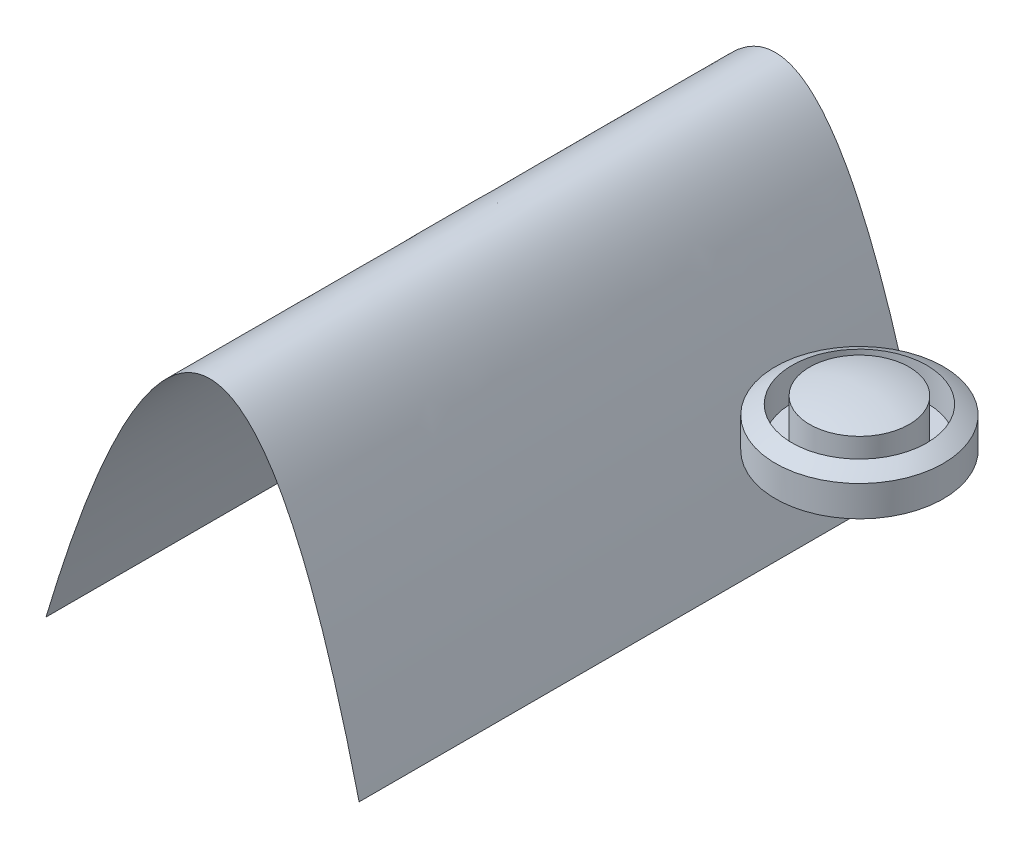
ISO-10303-21;
HEADER;
FILE_DESCRIPTION(('STEP AP214'),'2;1');
FILE_NAME('part.step','',(''),(''),'','','');
FILE_SCHEMA(('AUTOMOTIVE_DESIGN { 1 0 10303 214 1 1 1 1 }'));
ENDSEC;
DATA;
#1=APPLICATION_CONTEXT('core data for automotive mechanical design processes');
#2=APPLICATION_PROTOCOL_DEFINITION('international standard','automotive_design',2000,#1);
#3=PRODUCT_CONTEXT('',#1,'mechanical');
#4=PRODUCT('Part','Part','',(#3));
#5=PRODUCT_RELATED_PRODUCT_CATEGORY('part','',(#4));
#6=PRODUCT_DEFINITION_FORMATION('','',#4);
#7=PRODUCT_DEFINITION_CONTEXT('part definition',#1,'design');
#8=PRODUCT_DEFINITION('design','',#6,#7);
#9=PRODUCT_DEFINITION_SHAPE('','',#8);
#10=(LENGTH_UNIT() NAMED_UNIT(*) SI_UNIT(.MILLI.,.METRE.));
#11=(NAMED_UNIT(*) PLANE_ANGLE_UNIT() SI_UNIT($,.RADIAN.));
#12=(NAMED_UNIT(*) SI_UNIT($,.STERADIAN.) SOLID_ANGLE_UNIT());
#13=UNCERTAINTY_MEASURE_WITH_UNIT(LENGTH_MEASURE(1.E-05),#10,'distance_accuracy_value','');
#14=(GEOMETRIC_REPRESENTATION_CONTEXT(3) GLOBAL_UNCERTAINTY_ASSIGNED_CONTEXT((#13)) GLOBAL_UNIT_ASSIGNED_CONTEXT((#10,
#11,#12)) REPRESENTATION_CONTEXT('',''));
#15=CARTESIAN_POINT('',(0.,0.,0.));
#16=DIRECTION('',(0.,0.,1.));
#17=DIRECTION('',(1.,0.,0.));
#18=AXIS2_PLACEMENT_3D('',#15,#16,#17);
#19=CARTESIAN_POINT('',(-473.821321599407,-642.538076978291,0.));
#20=CARTESIAN_POINT('',(72.1268864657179,2392.33320040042,0.));
#21=CARTESIAN_POINT('',(271.28358560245,-7543.80415322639,0.));
#22=B_SPLINE_CURVE_WITH_KNOTS('',2,(#19,#20,#21),.UNSPECIFIED.,.F.,.F.,(3,3),(-1.12120975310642,
5.80782406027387),.UNSPECIFIED.);
#23=DIRECTION('',(0.,0.,1.));
#24=VECTOR('',#23,1.);
#25=SURFACE_OF_LINEAR_EXTRUSION('',#22,#24);
#26=CARTESIAN_POINT('',(-366.456659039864,-159.720150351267,-170.94200000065));
#27=CARTESIAN_POINT('',(-335.708917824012,-56.3519053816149,-170.94200000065));
#28=CARTESIAN_POINT('',(-306.218200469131,-1.11022302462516E-13,-170.94200000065));
#29=B_SPLINE_CURVE_WITH_KNOTS('',2,(#26,#27,#28),.UNSPECIFIED.,.F.,.F.,(3,3),
(-0.417167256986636,0.),.UNSPECIFIED.);
#30=CARTESIAN_POINT('',(-366.456659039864,-159.720150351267,-170.94200000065));
#31=VERTEX_POINT('',#30);
#32=CARTESIAN_POINT('',(-306.218200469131,0.,-170.94200000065));
#33=VERTEX_POINT('',#32);
#34=EDGE_CURVE('E99',#31,#33,#29,.T.);
#35=ORIENTED_EDGE('',*,*,#34,.T.);
#36=CARTESIAN_POINT('',(-306.218200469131,0.,-170.94200000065));
#37=CARTESIAN_POINT('',(-305.490933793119,1.38963738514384,-170.94200000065));
#38=CARTESIAN_POINT('',(-304.755353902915,2.77491752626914,-170.94200000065));
#39=CARTESIAN_POINT('',(-303.284911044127,5.50125506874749,-170.94200000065));
#40=CARTESIAN_POINT('',(-302.550491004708,6.8425514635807,-170.94200000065));
#41=CARTESIAN_POINT('',(-300.376662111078,10.7492851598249,-170.94200000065));
#42=CARTESIAN_POINT('',(-298.912636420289,13.3011186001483,-170.94200000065));
#43=CARTESIAN_POINT('',(-295.985464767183,18.2267521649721,-170.94200000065));
#44=CARTESIAN_POINT('',(-294.526264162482,20.6028911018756,-170.94200000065));
#45=CARTESIAN_POINT('',(-291.60841118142,25.1768444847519,-170.94200000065));
#46=CARTESIAN_POINT('',(-290.153997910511,27.3773527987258,-170.94200000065));
#47=CARTESIAN_POINT('',(-287.245403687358,31.5996784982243,-170.94200000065));
#48=CARTESIAN_POINT('',(-285.795758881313,33.6246067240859,-170.94200000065));
#49=CARTESIAN_POINT('',(-282.896411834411,37.4952811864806,-170.94200000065));
#50=CARTESIAN_POINT('',(-281.451532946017,39.3446266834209,-170.94200000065));
#51=CARTESIAN_POINT('',(-278.561295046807,42.8638117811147,-170.94200000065));
#52=CARTESIAN_POINT('',(-277.121026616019,44.5377972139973,-170.94200000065));
#53=CARTESIAN_POINT('',(-274.926915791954,46.9499758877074,-170.94200000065));
#54=CARTESIAN_POINT('',(-274.207837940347,47.7198935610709,-170.94200000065));
#55=CARTESIAN_POINT('',(-272.770156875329,49.2151464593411,-170.94200000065));
#56=CARTESIAN_POINT('',(-272.05222388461,49.9411242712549,-170.94200000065));
#57=CARTESIAN_POINT('',(-270.616852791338,51.348449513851,-170.94200000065));
#58=CARTESIAN_POINT('',(-269.900088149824,52.0304828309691,-170.94200000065));
#59=CARTESIAN_POINT('',(-268.467042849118,53.3498768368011,-170.94200000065));
#60=CARTESIAN_POINT('',(-267.751435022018,53.9879668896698,-170.94200000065));
#61=CARTESIAN_POINT('',(-266.320706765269,55.2194302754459,-170.94200000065));
#62=CARTESIAN_POINT('',(-265.606252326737,55.8135758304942,-170.94200000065));
#63=CARTESIAN_POINT('',(-264.177838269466,56.9571075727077,-170.94200000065));
#64=CARTESIAN_POINT('',(-263.464530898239,57.5073067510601,-170.94200000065));
#65=CARTESIAN_POINT('',(-262.038426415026,58.5629055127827,-170.94200000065));
#66=CARTESIAN_POINT('',(-261.326259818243,59.0691549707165,-170.94200000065));
#67=CARTESIAN_POINT('',(-259.902460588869,60.0368185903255,-170.94200000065));
#68=CARTESIAN_POINT('',(-259.19142791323,60.4991133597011,-170.94200000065));
#69=CARTESIAN_POINT('',(-257.769929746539,61.3788387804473,-170.94200000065));
#70=CARTESIAN_POINT('',(-257.060024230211,61.7971719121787,-170.94200000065));
#71=CARTESIAN_POINT('',(-255.64082299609,62.5889551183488,-170.94200000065));
#72=CARTESIAN_POINT('',(-254.932037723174,62.9633175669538,-170.94200000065));
#73=CARTESIAN_POINT('',(-253.51513136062,63.6671532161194,-170.94200000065));
#74=CARTESIAN_POINT('',(-252.807462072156,63.9975333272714,-170.94200000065));
#75=CARTESIAN_POINT('',(-251.392844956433,64.6134158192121,-170.94200000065));
#76=CARTESIAN_POINT('',(-250.686282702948,64.899800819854,-170.94200000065));
#77=CARTESIAN_POINT('',(-249.273967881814,65.4277205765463,-170.94200000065));
#78=CARTESIAN_POINT('',(-248.568528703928,65.6700918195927,-170.94200000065));
#79=CARTESIAN_POINT('',(-247.158469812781,66.1100493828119,-170.94200000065));
#80=CARTESIAN_POINT('',(-246.454090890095,66.3084014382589,-170.94200000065));
#81=CARTESIAN_POINT('',(-245.394192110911,66.5734140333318,-170.94200000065));
#82=CARTESIAN_POINT('',(-245.042572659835,66.655910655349,-170.94200000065));
#83=CARTESIAN_POINT('',(-244.339597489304,66.8098332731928,-170.94200000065));
#84=CARTESIAN_POINT('',(-243.988258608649,66.8813357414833,-170.94200000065));
#85=CARTESIAN_POINT('',(-243.285861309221,67.0132724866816,-170.94200000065));
#86=CARTESIAN_POINT('',(-242.934815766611,67.0737753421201,-170.94200000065));
#87=CARTESIAN_POINT('',(-242.233005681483,67.1837223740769,-170.94200000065));
#88=CARTESIAN_POINT('',(-241.882250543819,67.2332264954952,-170.94200000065));
#89=CARTESIAN_POINT('',(-241.181025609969,67.3211845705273,-170.94200000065));
#90=CARTESIAN_POINT('',(-240.830562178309,67.3596892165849,-170.94200000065));
#91=CARTESIAN_POINT('',(-240.129923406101,67.4256579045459,-170.94200000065));
#92=CARTESIAN_POINT('',(-239.779751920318,67.4531628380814,-170.94200000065));
#93=CARTESIAN_POINT('',(-239.079699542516,67.4971420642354,-170.94200000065));
#94=CARTESIAN_POINT('',(-238.729820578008,67.5136469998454,-170.94200000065));
#95=CARTESIAN_POINT('',(-238.030355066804,67.5356366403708,-170.94200000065));
#96=CARTESIAN_POINT('',(-237.680769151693,67.5411414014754,-170.94200000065));
#97=CARTESIAN_POINT('',(-236.981890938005,67.5411413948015,-170.94200000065));
#98=CARTESIAN_POINT('',(-236.632598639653,67.5356458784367,-170.94200000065));
#99=CARTESIAN_POINT('',(-235.934308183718,67.5136562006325,-170.94200000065));
#100=CARTESIAN_POINT('',(-235.58531007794,67.4971603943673,-170.94200000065));
#101=CARTESIAN_POINT('',(-234.887607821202,67.4531810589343,-170.94200000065));
#102=CARTESIAN_POINT('',(-234.538904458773,67.4256850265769,-170.94200000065));
#103=CARTESIAN_POINT('',(-233.841790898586,67.3597161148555,-170.94200000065));
#104=CARTESIAN_POINT('',(-233.493382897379,67.3212200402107,-170.94200000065));
#105=CARTESIAN_POINT('',(-232.796858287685,67.233261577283,-170.94200000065));
#106=CARTESIAN_POINT('',(-232.448745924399,67.1837655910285,-170.94200000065));
#107=CARTESIAN_POINT('',(-231.752811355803,67.0738180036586,-170.94200000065));
#108=CARTESIAN_POINT('',(-231.404996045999,67.0133228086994,-170.94200000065));
#109=CARTESIAN_POINT('',(-230.709649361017,66.8813851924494,-170.94200000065));
#110=CARTESIAN_POINT('',(-230.362128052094,66.8098896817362,-170.94200000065));
#111=CARTESIAN_POINT('',(-229.667379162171,66.6559662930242,-170.94200000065));
#112=CARTESIAN_POINT('',(-229.320165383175,66.5734764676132,-170.94200000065));
#113=CARTESIAN_POINT('',(-228.275140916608,66.3086412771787,-170.94200000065));
#114=CARTESIAN_POINT('',(-227.581312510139,66.1103326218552,-170.94200000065));
#115=CARTESIAN_POINT('',(-226.194731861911,65.6703604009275,-170.94200000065));
#116=CARTESIAN_POINT('',(-225.502195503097,65.4280214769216,-170.94200000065));
#117=CARTESIAN_POINT('',(-224.118060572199,64.9000829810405,-170.94200000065));
#118=CARTESIAN_POINT('',(-223.426753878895,64.6137197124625,-170.94200000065));
#119=CARTESIAN_POINT('',(-222.045018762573,63.9978149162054,-170.94200000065));
#120=CARTESIAN_POINT('',(-221.354959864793,63.6674470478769,-170.94200000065));
#121=CARTESIAN_POINT('',(-219.975639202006,62.9635862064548,-170.94200000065));
#122=CARTESIAN_POINT('',(-219.286820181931,62.5892280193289,-170.94200000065));
#123=CARTESIAN_POINT('',(-217.909909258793,61.7974175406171,-170.94200000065));
#124=CARTESIAN_POINT('',(-217.222326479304,61.3790823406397,-170.94200000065));
#125=CARTESIAN_POINT('',(-215.847823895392,60.4993283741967,-170.94200000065));
#126=CARTESIAN_POINT('',(-215.161470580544,60.0370268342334,-170.94200000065));
#127=CARTESIAN_POINT('',(-213.789372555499,59.06933414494,-170.94200000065));
#128=CARTESIAN_POINT('',(-213.104241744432,58.5630746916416,-170.94200000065));
#129=CARTESIAN_POINT('',(-211.734544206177,57.5074469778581,-170.94200000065));
#130=CARTESIAN_POINT('',(-211.050628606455,56.9572358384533,-170.94200000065));
#131=CARTESIAN_POINT('',(-209.683327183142,55.8136757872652,-170.94200000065));
#132=CARTESIAN_POINT('',(-209.000619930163,55.2195173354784,-170.94200000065));
#133=CARTESIAN_POINT('',(-207.635709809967,53.9880266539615,-170.94200000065));
#134=CARTESIAN_POINT('',(-206.954203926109,53.3499235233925,-170.94200000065));
#135=CARTESIAN_POINT('',(-205.591682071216,52.0305036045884,-170.94200000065));
#136=CARTESIAN_POINT('',(-204.911373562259,51.3484577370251,-170.94200000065));
#137=CARTESIAN_POINT('',(-203.551230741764,49.9411077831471,-170.94200000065));
#138=CARTESIAN_POINT('',(-202.872107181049,49.2151178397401,-170.94200000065));
#139=CARTESIAN_POINT('',(-201.514359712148,47.7198429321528,-170.94200000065));
#140=CARTESIAN_POINT('',(-200.836445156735,46.9499157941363,-170.94200000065));
#141=CARTESIAN_POINT('',(-198.771060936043,44.5374361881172,-170.94200000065));
#142=CARTESIAN_POINT('',(-197.42027465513,42.8633708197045,-170.94200000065));
#143=CARTESIAN_POINT('',(-194.718094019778,39.3440326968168,-170.94200000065));
#144=CARTESIAN_POINT('',(-193.372114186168,37.4946400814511,-170.94200000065));
#145=CARTESIAN_POINT('',(-190.679655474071,33.623845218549,-170.94200000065));
#146=CARTESIAN_POINT('',(-189.338312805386,31.5988851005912,-170.94200000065));
#147=CARTESIAN_POINT('',(-186.655427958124,27.3764560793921,-170.94200000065));
#148=CARTESIAN_POINT('',(-185.318716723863,25.1759326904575,-170.94200000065));
#149=CARTESIAN_POINT('',(-182.645391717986,20.6018943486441,-170.94200000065));
#150=CARTESIAN_POINT('',(-181.31328990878,18.2257535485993,-170.94200000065));
#151=CARTESIAN_POINT('',(-178.649461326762,13.3000471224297,-170.94200000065));
#152=CARTESIAN_POINT('',(-177.321929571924,10.7482191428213,-170.94200000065));
#153=CARTESIAN_POINT('',(-175.357397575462,6.84227320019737,-170.94200000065));
#154=CARTESIAN_POINT('',(-174.694704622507,5.5009792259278,-170.94200000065));
#155=CARTESIAN_POINT('',(-173.370041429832,2.77463602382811,-170.94200000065));
#156=CARTESIAN_POINT('',(-172.708541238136,1.38935830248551,-170.94200000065));
#157=CARTESIAN_POINT('',(-172.055711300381,-2.22044604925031E-13,-170.94200000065));
#158=B_SPLINE_CURVE_WITH_KNOTS('',3,(#36,#37,#38,#39,#40,#41,#42,#43,#44,#45,#46,#47,#48,#49,
#50,#51,#52,#53,#54,#55,#56,#57,#58,#59,#60,#61,#62,#63,#64,#65,#66,#67,#68,#69,#70,#71,#72,#73,
#74,#75,#76,#77,#78,#79,#80,#81,#82,#83,#84,#85,#86,#87,#88,#89,#90,#91,#92,#93,#94,#95,#96,#97,
#98,#99,#100,#101,#102,#103,#104,#105,#106,#107,#108,#109,#110,#111,#112,#113,#114,#115,#116,
#117,#118,#119,#120,#121,#122,#123,#124,#125,#126,#127,#128,#129,#130,#131,#132,#133,#134,#135,
#136,#137,#138,#139,#140,#141,#142,#143,#144,#145,#146,#147,#148,#149,#150,#151,#152,#153,#154,
#155,#156,#157),.UNSPECIFIED.,.F.,.F.,(4,2,2,2,2,2,2,2,2,2,2,2,2,2,2,2,2,2,2,2,2,2,2,2,2,2,2,2,
2,2,2,2,2,2,2,2,2,2,2,2,2,2,2,2,2,2,2,2,2,2,2,2,2,2,2,2,2,2,2,2,4),(0.,4.7052733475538,
9.29276950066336,18.1174417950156,26.4813475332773,34.392874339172,41.8619340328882,
48.9003080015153,55.52207684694,58.682193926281,61.7447852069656,64.712514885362,
67.5883108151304,70.3753905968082,73.0772887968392,75.6978846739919,78.2414295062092,
80.7125722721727,83.1163820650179,85.458365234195,87.744474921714,89.9811104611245,
92.175104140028,93.2584746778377,94.3339307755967,95.402432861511,96.4649602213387,
97.5225087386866,98.5760884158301,99.6267207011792,100.675435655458,101.723268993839,
102.771259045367,103.820443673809,104.871857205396,105.926527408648,106.985472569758,
108.049698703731,109.120196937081,111.283649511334,113.483623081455,115.727296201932,
118.021437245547,120.372378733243,122.786006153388,125.267759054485,127.822641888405,
130.455242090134,133.169753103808,135.97000040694,138.859468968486,141.841330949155,
144.918472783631,151.368296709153,158.227926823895,165.512573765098,173.234937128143,
181.405675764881,190.033786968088,194.52189637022,199.127113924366),.UNSPECIFIED.);
#159=CARTESIAN_POINT('',(-172.055711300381,-2.22044604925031E-13,-170.94200000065));
#160=VERTEX_POINT('',#159);
#161=EDGE_CURVE('E48',#33,#160,#158,.T.);
#162=ORIENTED_EDGE('',*,*,#161,.T.);
#163=CARTESIAN_POINT('',(-172.055711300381,-2.22044604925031E-13,-170.94200000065));
#164=CARTESIAN_POINT('',(-145.229416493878,-57.0942858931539,-170.94200000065));
#165=CARTESIAN_POINT('',(-119.693483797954,-162.451858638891,-170.94200000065));
#166=B_SPLINE_CURVE_WITH_KNOTS('',2,(#163,#164,#165),.UNSPECIFIED.,.F.,.F.,(3,3),(1.,
1.42266302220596),.UNSPECIFIED.);
#167=CARTESIAN_POINT('',(-119.693483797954,-162.45185863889,-170.94200000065));
#168=VERTEX_POINT('',#167);
#169=EDGE_CURVE('E147',#160,#168,#166,.T.);
#170=ORIENTED_EDGE('',*,*,#169,.T.);
#171=CARTESIAN_POINT('',(-119.693483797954,-162.45185863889,-170.94200000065));
#172=CARTESIAN_POINT('',(-119.693483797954,-162.45185863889,-169.16135416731));
#173=CARTESIAN_POINT('',(-119.693483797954,-162.45185863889,-167.38070833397));
#174=CARTESIAN_POINT('',(-119.693483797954,-162.45185863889,-163.81941666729));
#175=CARTESIAN_POINT('',(-119.693483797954,-162.45185863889,-162.03877083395));
#176=CARTESIAN_POINT('',(-119.693483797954,-162.45185863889,-158.47747916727));
#177=CARTESIAN_POINT('',(-119.693483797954,-162.45185863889,-156.69683333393));
#178=CARTESIAN_POINT('',(-119.693483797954,-162.45185863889,-153.135541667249));
#179=CARTESIAN_POINT('',(-119.693483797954,-162.45185863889,-151.354895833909));
#180=CARTESIAN_POINT('',(-119.693483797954,-162.45185863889,-147.793604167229));
#181=CARTESIAN_POINT('',(-119.693483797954,-162.45185863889,-146.012958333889));
#182=CARTESIAN_POINT('',(-119.693483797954,-162.45185863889,-142.451666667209));
#183=CARTESIAN_POINT('',(-119.693483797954,-162.45185863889,-140.671020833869));
#184=CARTESIAN_POINT('',(-119.693483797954,-162.45185863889,-137.109729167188));
#185=CARTESIAN_POINT('',(-119.693483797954,-162.45185863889,-135.329083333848));
#186=CARTESIAN_POINT('',(-119.693483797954,-162.45185863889,-131.767791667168));
#187=CARTESIAN_POINT('',(-119.693483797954,-162.45185863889,-129.987145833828));
#188=CARTESIAN_POINT('',(-119.693483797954,-162.45185863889,-126.425854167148));
#189=CARTESIAN_POINT('',(-119.693483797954,-162.45185863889,-124.645208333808));
#190=CARTESIAN_POINT('',(-119.693483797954,-162.45185863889,-121.083916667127));
#191=CARTESIAN_POINT('',(-119.693483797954,-162.45185863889,-119.303270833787));
#192=CARTESIAN_POINT('',(-119.693483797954,-162.45185863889,-115.741979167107));
#193=CARTESIAN_POINT('',(-119.693483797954,-162.45185863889,-113.961333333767));
#194=CARTESIAN_POINT('',(-119.693483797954,-162.45185863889,-110.400041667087));
#195=CARTESIAN_POINT('',(-119.693483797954,-162.45185863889,-108.619395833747));
#196=CARTESIAN_POINT('',(-119.693483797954,-162.45185863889,-105.058104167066));
#197=CARTESIAN_POINT('',(-119.693483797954,-162.45185863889,-103.277458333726));
#198=CARTESIAN_POINT('',(-119.693483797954,-162.45185863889,-99.7161666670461));
#199=CARTESIAN_POINT('',(-119.693483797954,-162.45185863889,-97.935520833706));
#200=CARTESIAN_POINT('',(-119.693483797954,-162.45185863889,-94.3742291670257));
#201=CARTESIAN_POINT('',(-119.693483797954,-162.45185863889,-92.5935833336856));
#202=CARTESIAN_POINT('',(-119.693483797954,-162.45185863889,-89.0322916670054));
#203=CARTESIAN_POINT('',(-119.693483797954,-162.45185863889,-87.2516458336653));
#204=CARTESIAN_POINT('',(-119.693483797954,-162.45185863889,-83.6903541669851));
#205=CARTESIAN_POINT('',(-119.693483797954,-162.45185863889,-81.909708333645));
#206=CARTESIAN_POINT('',(-119.693483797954,-162.45185863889,-78.3484166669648));
#207=CARTESIAN_POINT('',(-119.693483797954,-162.45185863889,-76.5677708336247));
#208=CARTESIAN_POINT('',(-119.693483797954,-162.45185863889,-73.0064791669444));
#209=CARTESIAN_POINT('',(-119.693483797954,-162.45185863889,-71.2258333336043));
#210=CARTESIAN_POINT('',(-119.693483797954,-162.45185863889,-67.6645416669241));
#211=CARTESIAN_POINT('',(-119.693483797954,-162.45185863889,-65.883895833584));
#212=CARTESIAN_POINT('',(-119.693483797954,-162.45185863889,-62.3226041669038));
#213=CARTESIAN_POINT('',(-119.693483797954,-162.45185863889,-60.5419583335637));
#214=CARTESIAN_POINT('',(-119.693483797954,-162.45185863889,-56.9806666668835));
#215=CARTESIAN_POINT('',(-119.693483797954,-162.45185863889,-55.2000208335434));
#216=CARTESIAN_POINT('',(-119.693483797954,-162.45185863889,-51.6387291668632));
#217=CARTESIAN_POINT('',(-119.693483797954,-162.45185863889,-49.858083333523));
#218=CARTESIAN_POINT('',(-119.693483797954,-162.45185863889,-46.2967916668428));
#219=CARTESIAN_POINT('',(-119.693483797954,-162.45185863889,-44.5161458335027));
#220=CARTESIAN_POINT('',(-119.693483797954,-162.45185863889,-40.9548541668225));
#221=CARTESIAN_POINT('',(-119.693483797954,-162.45185863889,-39.1742083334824));
#222=CARTESIAN_POINT('',(-119.693483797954,-162.45185863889,-35.6129166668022));
#223=CARTESIAN_POINT('',(-119.693483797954,-162.45185863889,-33.8322708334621));
#224=CARTESIAN_POINT('',(-119.693483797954,-162.45185863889,-30.2709791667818));
#225=CARTESIAN_POINT('',(-119.693483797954,-162.45185863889,-28.4903333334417));
#226=CARTESIAN_POINT('',(-119.693483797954,-162.45185863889,-24.9290416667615));
#227=CARTESIAN_POINT('',(-119.693483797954,-162.45185863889,-23.1483958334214));
#228=CARTESIAN_POINT('',(-119.693483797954,-162.45185863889,-19.5871041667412));
#229=CARTESIAN_POINT('',(-119.693483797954,-162.45185863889,-17.8064583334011));
#230=CARTESIAN_POINT('',(-119.693483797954,-162.45185863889,-14.2451666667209));
#231=CARTESIAN_POINT('',(-119.693483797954,-162.45185863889,-12.4645208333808));
#232=CARTESIAN_POINT('',(-119.693483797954,-162.45185863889,-8.90322916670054));
#233=CARTESIAN_POINT('',(-119.693483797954,-162.45185863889,-7.12258333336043));
#234=CARTESIAN_POINT('',(-119.693483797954,-162.45185863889,-3.56129166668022));
#235=CARTESIAN_POINT('',(-119.693483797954,-162.45185863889,-1.78064583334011));
#236=CARTESIAN_POINT('',(-119.693483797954,-162.45185863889,0.));
#237=B_SPLINE_CURVE_WITH_KNOTS('',3,(#171,#172,#173,#174,#175,#176,#177,#178,#179,#180,#181,
#182,#183,#184,#185,#186,#187,#188,#189,#190,#191,#192,#193,#194,#195,#196,#197,#198,#199,#200,
#201,#202,#203,#204,#205,#206,#207,#208,#209,#210,#211,#212,#213,#214,#215,#216,#217,#218,#219,
#220,#221,#222,#223,#224,#225,#226,#227,#228,#229,#230,#231,#232,#233,#234,#235,#236),
.UNSPECIFIED.,.F.,.F.,(4,2,2,2,2,2,2,2,2,2,2,2,2,2,2,2,2,2,2,2,2,2,2,2,2,2,2,2,2,2,2,2,4),(0.,
5.34193750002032,10.6838750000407,16.025812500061,21.3677500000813,26.7096875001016,
32.0516250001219,37.3935625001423,42.7355000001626,48.0774375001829,53.4193750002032,
58.7613125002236,64.1032500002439,69.4451875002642,74.7871250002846,80.1290625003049,
85.4710000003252,90.8129375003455,96.1548750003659,101.496812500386,106.838750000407,
112.180687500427,117.522625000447,122.864562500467,128.206500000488,133.548437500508,
138.890375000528,144.232312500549,149.574250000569,154.916187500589,160.25812500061,
165.60006250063,170.94200000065),.UNSPECIFIED.);
#238=CARTESIAN_POINT('',(-119.693483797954,-162.45185863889,0.));
#239=VERTEX_POINT('',#238);
#240=EDGE_CURVE('E107',#168,#239,#237,.T.);
#241=ORIENTED_EDGE('',*,*,#240,.T.);
#242=CARTESIAN_POINT('',(-119.693483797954,-162.45185863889,0.));
#243=CARTESIAN_POINT('',(-119.693483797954,-162.45185863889,1.0795));
#244=CARTESIAN_POINT('',(-119.693483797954,-162.45185863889,2.159));
#245=CARTESIAN_POINT('',(-119.693483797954,-162.45185863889,4.318));
#246=CARTESIAN_POINT('',(-119.693483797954,-162.45185863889,5.3975));
#247=CARTESIAN_POINT('',(-119.693483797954,-162.45185863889,7.5565));
#248=CARTESIAN_POINT('',(-119.693483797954,-162.45185863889,8.636));
#249=CARTESIAN_POINT('',(-119.693483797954,-162.45185863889,10.795));
#250=CARTESIAN_POINT('',(-119.693483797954,-162.45185863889,11.8745));
#251=CARTESIAN_POINT('',(-119.693483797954,-162.45185863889,14.0335));
#252=CARTESIAN_POINT('',(-119.693483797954,-162.45185863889,15.113));
#253=CARTESIAN_POINT('',(-119.693483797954,-162.45185863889,17.272));
#254=CARTESIAN_POINT('',(-119.693483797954,-162.45185863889,18.3515));
#255=CARTESIAN_POINT('',(-119.693483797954,-162.45185863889,20.5105));
#256=CARTESIAN_POINT('',(-119.693483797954,-162.45185863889,21.59));
#257=CARTESIAN_POINT('',(-119.693483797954,-162.45185863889,23.749));
#258=CARTESIAN_POINT('',(-119.693483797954,-162.45185863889,24.8285));
#259=CARTESIAN_POINT('',(-119.693483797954,-162.45185863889,26.9875));
#260=CARTESIAN_POINT('',(-119.693483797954,-162.45185863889,28.067));
#261=CARTESIAN_POINT('',(-119.693483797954,-162.45185863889,30.226));
#262=CARTESIAN_POINT('',(-119.693483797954,-162.45185863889,31.3055));
#263=CARTESIAN_POINT('',(-119.693483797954,-162.45185863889,33.4645));
#264=CARTESIAN_POINT('',(-119.693483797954,-162.45185863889,34.544));
#265=CARTESIAN_POINT('',(-119.693483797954,-162.45185863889,36.703));
#266=CARTESIAN_POINT('',(-119.693483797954,-162.45185863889,37.7825));
#267=CARTESIAN_POINT('',(-119.693483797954,-162.45185863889,39.9415));
#268=CARTESIAN_POINT('',(-119.693483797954,-162.45185863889,41.021));
#269=CARTESIAN_POINT('',(-119.693483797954,-162.45185863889,43.18));
#270=CARTESIAN_POINT('',(-119.693483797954,-162.45185863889,44.2595));
#271=CARTESIAN_POINT('',(-119.693483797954,-162.45185863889,46.4185));
#272=CARTESIAN_POINT('',(-119.693483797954,-162.45185863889,47.498));
#273=CARTESIAN_POINT('',(-119.693483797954,-162.45185863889,49.657));
#274=CARTESIAN_POINT('',(-119.693483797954,-162.45185863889,50.7365));
#275=CARTESIAN_POINT('',(-119.693483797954,-162.45185863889,52.8955));
#276=CARTESIAN_POINT('',(-119.693483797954,-162.45185863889,53.975));
#277=CARTESIAN_POINT('',(-119.693483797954,-162.45185863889,56.134));
#278=CARTESIAN_POINT('',(-119.693483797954,-162.45185863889,57.2135));
#279=CARTESIAN_POINT('',(-119.693483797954,-162.45185863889,59.3725));
#280=CARTESIAN_POINT('',(-119.693483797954,-162.45185863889,60.452));
#281=CARTESIAN_POINT('',(-119.693483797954,-162.45185863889,62.611));
#282=CARTESIAN_POINT('',(-119.693483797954,-162.45185863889,63.6905));
#283=CARTESIAN_POINT('',(-119.693483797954,-162.45185863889,65.8495));
#284=CARTESIAN_POINT('',(-119.693483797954,-162.45185863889,66.929));
#285=CARTESIAN_POINT('',(-119.693483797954,-162.45185863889,69.088));
#286=CARTESIAN_POINT('',(-119.693483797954,-162.45185863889,70.1675));
#287=CARTESIAN_POINT('',(-119.693483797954,-162.45185863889,72.3265));
#288=CARTESIAN_POINT('',(-119.693483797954,-162.45185863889,73.406));
#289=CARTESIAN_POINT('',(-119.693483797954,-162.45185863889,75.565));
#290=CARTESIAN_POINT('',(-119.693483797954,-162.45185863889,76.6445));
#291=CARTESIAN_POINT('',(-119.693483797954,-162.45185863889,78.8035));
#292=CARTESIAN_POINT('',(-119.693483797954,-162.45185863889,79.883));
#293=CARTESIAN_POINT('',(-119.693483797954,-162.45185863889,82.042));
#294=CARTESIAN_POINT('',(-119.693483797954,-162.45185863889,83.1215));
#295=CARTESIAN_POINT('',(-119.693483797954,-162.45185863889,85.2805));
#296=CARTESIAN_POINT('',(-119.693483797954,-162.45185863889,86.36));
#297=CARTESIAN_POINT('',(-119.693483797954,-162.45185863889,88.519));
#298=CARTESIAN_POINT('',(-119.693483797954,-162.45185863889,89.5985));
#299=CARTESIAN_POINT('',(-119.693483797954,-162.45185863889,91.7575));
#300=CARTESIAN_POINT('',(-119.693483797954,-162.45185863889,92.837));
#301=CARTESIAN_POINT('',(-119.693483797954,-162.45185863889,94.996));
#302=CARTESIAN_POINT('',(-119.693483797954,-162.45185863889,96.0755));
#303=CARTESIAN_POINT('',(-119.693483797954,-162.45185863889,98.2345));
#304=CARTESIAN_POINT('',(-119.693483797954,-162.45185863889,99.314));
#305=CARTESIAN_POINT('',(-119.693483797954,-162.45185863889,101.473));
#306=CARTESIAN_POINT('',(-119.693483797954,-162.45185863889,102.5525));
#307=CARTESIAN_POINT('',(-119.693483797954,-162.45185863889,103.632));
#308=B_SPLINE_CURVE_WITH_KNOTS('',3,(#242,#243,#244,#245,#246,#247,#248,#249,#250,#251,#252,
#253,#254,#255,#256,#257,#258,#259,#260,#261,#262,#263,#264,#265,#266,#267,#268,#269,#270,#271,
#272,#273,#274,#275,#276,#277,#278,#279,#280,#281,#282,#283,#284,#285,#286,#287,#288,#289,#290,
#291,#292,#293,#294,#295,#296,#297,#298,#299,#300,#301,#302,#303,#304,#305,#306,#307),
.UNSPECIFIED.,.F.,.F.,(4,2,2,2,2,2,2,2,2,2,2,2,2,2,2,2,2,2,2,2,2,2,2,2,2,2,2,2,2,2,2,2,4),(0.,
3.2385,6.477,9.7155,12.954,16.1925,19.431,22.6695,25.908,29.1465,32.385,35.6235,38.862,42.1005,
45.339,48.5775,51.816,55.0545,58.293,61.5315,64.77,68.0085,71.247,74.4855,77.724,80.9625,84.201,
87.4395,90.678,93.9165,97.155,100.3935,103.632),.UNSPECIFIED.);
#309=CARTESIAN_POINT('',(-119.693483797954,-162.45185863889,103.632));
#310=VERTEX_POINT('',#309);
#311=EDGE_CURVE('E93',#239,#310,#308,.T.);
#312=ORIENTED_EDGE('',*,*,#311,.T.);
#313=CARTESIAN_POINT('',(-119.693483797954,-162.45185863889,103.632));
#314=DIRECTION('',(0.,0.,1.));
#315=VECTOR('',#314,1.);
#316=LINE('',#313,#315);
#317=CARTESIAN_POINT('',(-119.693483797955,-162.451858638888,274.574));
#318=VERTEX_POINT('',#317);
#319=EDGE_CURVE('E169',#310,#318,#316,.T.);
#320=ORIENTED_EDGE('',*,*,#319,.T.);
#321=CARTESIAN_POINT('',(-119.693483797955,-162.451858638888,274.574));
#322=CARTESIAN_POINT('',(-120.221914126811,-160.271648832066,274.57400000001));
#323=CARTESIAN_POINT('',(-120.754276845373,-158.092390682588,274.57400000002));
#324=CARTESIAN_POINT('',(-121.819954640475,-153.765323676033,274.574000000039));
#325=CARTESIAN_POINT('',(-122.35315967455,-151.617487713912,274.574000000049));
#326=CARTESIAN_POINT('',(-123.420520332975,-147.35326422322,274.574000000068));
#327=CARTESIAN_POINT('',(-123.954563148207,-145.236848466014,274.574000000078));
#328=CARTESIAN_POINT('',(-125.023603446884,-141.035467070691,274.574000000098));
#329=CARTESIAN_POINT('',(-125.558485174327,-138.950471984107,274.574000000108));
#330=CARTESIAN_POINT('',(-126.629205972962,-134.81193302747,274.574000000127));
#331=CARTESIAN_POINT('',(-127.164926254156,-132.758358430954,274.574000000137));
#332=CARTESIAN_POINT('',(-128.23732734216,-128.682661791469,274.574000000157));
#333=CARTESIAN_POINT('',(-128.773886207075,-126.660507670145,274.574000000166));
#334=CARTESIAN_POINT('',(-129.847967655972,-122.647653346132,274.574000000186));
#335=CARTESIAN_POINT('',(-130.385365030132,-120.656919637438,274.574000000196));
#336=CARTESIAN_POINT('',(-131.461126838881,-116.706907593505,274.574000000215));
#337=CARTESIAN_POINT('',(-131.999362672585,-114.747594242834,274.574000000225));
#338=CARTESIAN_POINT('',(-133.076804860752,-110.860424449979,274.574000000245));
#339=CARTESIAN_POINT('',(-133.615879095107,-108.932531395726,274.574000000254));
#340=CARTESIAN_POINT('',(-134.695001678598,-105.108203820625,274.574000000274));
#341=CARTESIAN_POINT('',(-135.234914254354,-103.211730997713,274.574000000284));
#342=CARTESIAN_POINT('',(-136.315717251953,-99.4502456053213,274.574000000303));
#343=CARTESIAN_POINT('',(-136.856468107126,-97.5851929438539,274.574000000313));
#344=CARTESIAN_POINT('',(-137.938951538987,-93.8865496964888,274.574000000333));
#345=CARTESIAN_POINT('',(-138.480540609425,-92.0529171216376,274.574000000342));
#346=CARTESIAN_POINT('',(-139.564704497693,-88.4171159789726,274.574000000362));
#347=CARTESIAN_POINT('',(-140.107131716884,-86.6149034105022,274.574000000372));
#348=CARTESIAN_POINT('',(-141.192976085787,-83.0419443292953,274.574000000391));
#349=CARTESIAN_POINT('',(-141.736241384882,-81.2711516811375,274.574000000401));
#350=CARTESIAN_POINT('',(-142.823766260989,-77.7610346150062,274.574000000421));
#351=CARTESIAN_POINT('',(-143.367869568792,-76.021661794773,274.57400000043));
#352=CARTESIAN_POINT('',(-144.457074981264,-72.5743866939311,274.57400000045));
#353=CARTESIAN_POINT('',(-145.002016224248,-70.8664336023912,274.57400000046));
#354=CARTESIAN_POINT('',(-146.092902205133,-67.482000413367,274.574000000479));
#355=CARTESIAN_POINT('',(-146.638681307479,-65.8054669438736,274.574000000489));
#356=CARTESIAN_POINT('',(-147.731247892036,-62.4838756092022,274.574000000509));
#357=CARTESIAN_POINT('',(-148.27786477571,-60.838761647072,274.574000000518));
#358=CARTESIAN_POINT('',(-149.372112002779,-57.58001210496,274.574000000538));
#359=CARTESIAN_POINT('',(-149.919566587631,-55.9663175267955,274.574000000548));
#360=CARTESIAN_POINT('',(-151.01549450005,-52.7704097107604,274.574000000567));
#361=CARTESIAN_POINT('',(-151.563786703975,-51.1881343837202,274.574000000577));
#362=CARTESIAN_POINT('',(-152.66139534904,-48.0550682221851,274.574000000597));
#363=CARTESIAN_POINT('',(-153.210525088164,-46.5042120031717,274.574000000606));
#364=CARTESIAN_POINT('',(-154.3098145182,-43.4339874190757,274.574000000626));
#365=CARTESIAN_POINT('',(-154.859781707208,-41.9145501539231,274.574000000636));
#366=CARTESIAN_POINT('',(-155.960751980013,-38.907167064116,274.574000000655));
#367=CARTESIAN_POINT('',(-156.511556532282,-37.4191485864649,274.574000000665));
#368=CARTESIAN_POINT('',(-157.614207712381,-34.4746069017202,274.574000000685));
#369=CARTESIAN_POINT('',(-158.165849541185,-33.0180070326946,274.574000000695));
#370=CARTESIAN_POINT('',(-159.270181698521,-30.1363066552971,274.574000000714));
#371=CARTESIAN_POINT('',(-159.822660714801,-28.7111251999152,274.574000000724));
#372=CARTESIAN_POINT('',(-160.928673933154,-25.8922660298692,274.574000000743));
#373=CARTESIAN_POINT('',(-161.481990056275,-24.4985027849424,274.574000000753));
#374=CARTESIAN_POINT('',(-162.589684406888,-21.7424846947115,274.574000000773));
#375=CARTESIAN_POINT('',(-163.143837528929,-20.3801394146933,274.574000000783));
#376=CARTESIAN_POINT('',(-164.253213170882,-17.6869623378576,274.574000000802));
#377=CARTESIAN_POINT('',(-164.808203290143,-16.3560348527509,274.574000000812));
#378=CARTESIAN_POINT('',(-165.919260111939,-13.7256984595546,274.574000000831));
#379=CARTESIAN_POINT('',(-166.475086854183,-12.4261882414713,274.574000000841));
#380=CARTESIAN_POINT('',(-167.587825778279,-9.85869311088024,274.574000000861));
#381=CARTESIAN_POINT('',(-168.144490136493,-8.59060083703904,274.574000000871));
#382=CARTESIAN_POINT('',(-169.258908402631,-6.08594420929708,274.57400000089));
#383=CARTESIAN_POINT('',(-169.816406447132,-4.84926609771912,274.5740000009));
#384=CARTESIAN_POINT('',(-170.932514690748,-2.40745724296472,274.574000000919));
#385=CARTESIAN_POINT('',(-171.490860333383,-1.20220553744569,274.574000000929));
#386=CARTESIAN_POINT('',(-172.055711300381,-2.22044604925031E-13,274.574000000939));
#387=B_SPLINE_CURVE_WITH_KNOTS('',3,(#321,#322,#323,#324,#325,#326,#327,#328,#329,#330,#331,
#332,#333,#334,#335,#336,#337,#338,#339,#340,#341,#342,#343,#344,#345,#346,#347,#348,#349,#350,
#351,#352,#353,#354,#355,#356,#357,#358,#359,#360,#361,#362,#363,#364,#365,#366,#367,#368,#369,
#370,#371,#372,#373,#374,#375,#376,#377,#378,#379,#380,#381,#382,#383,#384,#385,#386),
.UNSPECIFIED.,.F.,.F.,(4,2,2,2,2,2,2,2,2,2,2,2,2,2,2,2,2,2,2,2,2,2,2,2,2,2,2,2,2,2,2,2,4),(0.,
6.73000440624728,13.3690824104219,19.9173293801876,26.374844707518,32.7417320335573,
39.0180994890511,45.2040599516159,51.2997313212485,57.3052368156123,63.2207052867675,
69.0462715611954,74.7820768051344,80.4282689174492,85.9850029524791,91.4524415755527,
96.8307555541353,102.120124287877,107.320736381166,112.432790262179,117.456494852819,
122.392070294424,127.239748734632,131.999775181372,136.6724084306,141.257922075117,
145.756605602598,150.168765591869,154.494727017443,158.734834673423,162.889454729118,
166.958976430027,170.943813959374),.UNSPECIFIED.);
#388=CARTESIAN_POINT('',(-172.055711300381,0.,274.574000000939));
#389=VERTEX_POINT('',#388);
#390=EDGE_CURVE('E144',#318,#389,#387,.T.);
#391=ORIENTED_EDGE('',*,*,#390,.T.);
#392=CARTESIAN_POINT('',(-172.055711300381,0.,274.574000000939));
#393=CARTESIAN_POINT('',(-172.708541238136,1.38935830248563,274.574000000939));
#394=CARTESIAN_POINT('',(-173.370041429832,2.77463602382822,274.574000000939));
#395=CARTESIAN_POINT('',(-174.694704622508,5.50097922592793,274.574000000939));
#396=CARTESIAN_POINT('',(-175.357397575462,6.84227320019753,274.574000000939));
#397=CARTESIAN_POINT('',(-177.321929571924,10.7482191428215,274.574000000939));
#398=CARTESIAN_POINT('',(-178.649461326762,13.3000471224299,274.574000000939));
#399=CARTESIAN_POINT('',(-181.31328990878,18.2257535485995,274.574000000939));
#400=CARTESIAN_POINT('',(-182.645391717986,20.6018943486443,274.574000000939));
#401=CARTESIAN_POINT('',(-185.318716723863,25.1759326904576,274.574000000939));
#402=CARTESIAN_POINT('',(-186.655427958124,27.3764560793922,274.574000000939));
#403=CARTESIAN_POINT('',(-189.338312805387,31.5988851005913,274.574000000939));
#404=CARTESIAN_POINT('',(-190.679655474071,33.6238452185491,274.574000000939));
#405=CARTESIAN_POINT('',(-193.372114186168,37.4946400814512,274.574000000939));
#406=CARTESIAN_POINT('',(-194.718094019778,39.3440326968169,274.574000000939));
#407=CARTESIAN_POINT('',(-197.42027465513,42.8633708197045,274.574000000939));
#408=CARTESIAN_POINT('',(-198.771060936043,44.5374361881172,274.574000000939));
#409=CARTESIAN_POINT('',(-200.836445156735,46.9499157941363,274.574000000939));
#410=CARTESIAN_POINT('',(-201.514359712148,47.7198429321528,274.574000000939));
#411=CARTESIAN_POINT('',(-202.872107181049,49.2151178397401,274.574000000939));
#412=CARTESIAN_POINT('',(-203.551230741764,49.9411077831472,274.574000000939));
#413=CARTESIAN_POINT('',(-204.911373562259,51.3484577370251,274.574000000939));
#414=CARTESIAN_POINT('',(-205.591682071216,52.0305036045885,274.574000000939));
#415=CARTESIAN_POINT('',(-206.954203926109,53.3499235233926,274.574000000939));
#416=CARTESIAN_POINT('',(-207.635709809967,53.9880266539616,274.574000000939));
#417=CARTESIAN_POINT('',(-209.000619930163,55.2195173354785,274.574000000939));
#418=CARTESIAN_POINT('',(-209.683327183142,55.8136757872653,274.574000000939));
#419=CARTESIAN_POINT('',(-211.050628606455,56.9572358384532,274.574000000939));
#420=CARTESIAN_POINT('',(-211.734544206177,57.507446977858,274.574000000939));
#421=CARTESIAN_POINT('',(-213.104241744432,58.5630746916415,274.574000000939));
#422=CARTESIAN_POINT('',(-213.789372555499,59.06933414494,274.574000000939));
#423=CARTESIAN_POINT('',(-215.161470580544,60.0370268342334,274.574000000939));
#424=CARTESIAN_POINT('',(-215.847823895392,60.4993283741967,274.574000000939));
#425=CARTESIAN_POINT('',(-217.222326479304,61.3790823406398,274.574000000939));
#426=CARTESIAN_POINT('',(-217.909909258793,61.7974175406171,274.574000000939));
#427=CARTESIAN_POINT('',(-219.286820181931,62.589228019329,274.574000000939));
#428=CARTESIAN_POINT('',(-219.975639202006,62.9635862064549,274.574000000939));
#429=CARTESIAN_POINT('',(-221.354959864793,63.667447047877,274.574000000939));
#430=CARTESIAN_POINT('',(-222.045018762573,63.9978149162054,274.574000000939));
#431=CARTESIAN_POINT('',(-223.426753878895,64.6137197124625,274.574000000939));
#432=CARTESIAN_POINT('',(-224.118060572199,64.9000829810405,274.574000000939));
#433=CARTESIAN_POINT('',(-225.502195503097,65.4280214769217,274.574000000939));
#434=CARTESIAN_POINT('',(-226.194731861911,65.6703604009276,274.574000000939));
#435=CARTESIAN_POINT('',(-227.581312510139,66.1103326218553,274.574000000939));
#436=CARTESIAN_POINT('',(-228.275140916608,66.3086412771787,274.574000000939));
#437=CARTESIAN_POINT('',(-229.320165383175,66.5734764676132,274.574000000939));
#438=CARTESIAN_POINT('',(-229.667379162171,66.6559662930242,274.574000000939));
#439=CARTESIAN_POINT('',(-230.362128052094,66.8098896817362,274.574000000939));
#440=CARTESIAN_POINT('',(-230.709649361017,66.8813851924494,274.574000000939));
#441=CARTESIAN_POINT('',(-231.404996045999,67.0133228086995,274.574000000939));
#442=CARTESIAN_POINT('',(-231.752811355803,67.0738180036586,274.574000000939));
#443=CARTESIAN_POINT('',(-232.448745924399,67.1837655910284,274.574000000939));
#444=CARTESIAN_POINT('',(-232.796858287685,67.233261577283,274.574000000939));
#445=CARTESIAN_POINT('',(-233.493382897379,67.3212200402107,274.574000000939));
#446=CARTESIAN_POINT('',(-233.841790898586,67.3597161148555,274.574000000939));
#447=CARTESIAN_POINT('',(-234.538904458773,67.4256850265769,274.574000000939));
#448=CARTESIAN_POINT('',(-234.887607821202,67.4531810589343,274.574000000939));
#449=CARTESIAN_POINT('',(-235.58531007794,67.4971603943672,274.574000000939));
#450=CARTESIAN_POINT('',(-235.934308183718,67.5136562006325,274.574000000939));
#451=CARTESIAN_POINT('',(-236.632598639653,67.5356458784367,274.574000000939));
#452=CARTESIAN_POINT('',(-236.981890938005,67.5411413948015,274.574000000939));
#453=CARTESIAN_POINT('',(-237.680769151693,67.5411414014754,274.574000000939));
#454=CARTESIAN_POINT('',(-238.030355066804,67.5356366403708,274.574000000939));
#455=CARTESIAN_POINT('',(-238.729820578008,67.5136469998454,274.574000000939));
#456=CARTESIAN_POINT('',(-239.079699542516,67.4971420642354,274.574000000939));
#457=CARTESIAN_POINT('',(-239.779751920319,67.4531628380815,274.574000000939));
#458=CARTESIAN_POINT('',(-240.129923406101,67.425657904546,274.574000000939));
#459=CARTESIAN_POINT('',(-240.830562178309,67.3596892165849,274.574000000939));
#460=CARTESIAN_POINT('',(-241.181025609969,67.3211845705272,274.574000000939));
#461=CARTESIAN_POINT('',(-241.882250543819,67.2332264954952,274.574000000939));
#462=CARTESIAN_POINT('',(-242.233005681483,67.1837223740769,274.574000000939));
#463=CARTESIAN_POINT('',(-242.934815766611,67.0737753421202,274.574000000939));
#464=CARTESIAN_POINT('',(-243.285861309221,67.0132724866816,274.574000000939));
#465=CARTESIAN_POINT('',(-243.988258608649,66.8813357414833,274.574000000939));
#466=CARTESIAN_POINT('',(-244.339597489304,66.8098332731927,274.574000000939));
#467=CARTESIAN_POINT('',(-245.042572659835,66.6559106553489,274.574000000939));
#468=CARTESIAN_POINT('',(-245.394192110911,66.5734140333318,274.574000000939));
#469=CARTESIAN_POINT('',(-246.454090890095,66.308401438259,274.574000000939));
#470=CARTESIAN_POINT('',(-247.158469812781,66.1100493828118,274.574000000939));
#471=CARTESIAN_POINT('',(-248.568528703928,65.6700918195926,274.574000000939));
#472=CARTESIAN_POINT('',(-249.273967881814,65.4277205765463,274.574000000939));
#473=CARTESIAN_POINT('',(-250.686282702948,64.8998008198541,274.574000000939));
#474=CARTESIAN_POINT('',(-251.392844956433,64.6134158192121,274.574000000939));
#475=CARTESIAN_POINT('',(-252.807462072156,63.9975333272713,274.574000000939));
#476=CARTESIAN_POINT('',(-253.51513136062,63.6671532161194,274.574000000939));
#477=CARTESIAN_POINT('',(-254.932037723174,62.9633175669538,274.574000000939));
#478=CARTESIAN_POINT('',(-255.64082299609,62.5889551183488,274.574000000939));
#479=CARTESIAN_POINT('',(-257.060024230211,61.7971719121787,274.574000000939));
#480=CARTESIAN_POINT('',(-257.769929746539,61.3788387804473,274.574000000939));
#481=CARTESIAN_POINT('',(-259.19142791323,60.4991133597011,274.574000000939));
#482=CARTESIAN_POINT('',(-259.902460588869,60.0368185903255,274.574000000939));
#483=CARTESIAN_POINT('',(-261.326259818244,59.0691549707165,274.574000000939));
#484=CARTESIAN_POINT('',(-262.038426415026,58.5629055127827,274.574000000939));
#485=CARTESIAN_POINT('',(-263.464530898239,57.50730675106,274.574000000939));
#486=CARTESIAN_POINT('',(-264.177838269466,56.9571075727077,274.574000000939));
#487=CARTESIAN_POINT('',(-265.606252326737,55.8135758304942,274.574000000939));
#488=CARTESIAN_POINT('',(-266.320706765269,55.2194302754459,274.574000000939));
#489=CARTESIAN_POINT('',(-267.751435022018,53.9879668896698,274.574000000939));
#490=CARTESIAN_POINT('',(-268.467042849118,53.349876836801,274.574000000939));
#491=CARTESIAN_POINT('',(-269.900088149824,52.030482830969,274.574000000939));
#492=CARTESIAN_POINT('',(-270.616852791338,51.3484495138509,274.574000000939));
#493=CARTESIAN_POINT('',(-272.05222388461,49.9411242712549,274.574000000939));
#494=CARTESIAN_POINT('',(-272.770156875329,49.2151464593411,274.574000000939));
#495=CARTESIAN_POINT('',(-274.207837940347,47.7198935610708,274.574000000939));
#496=CARTESIAN_POINT('',(-274.926915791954,46.9499758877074,274.574000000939));
#497=CARTESIAN_POINT('',(-277.121026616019,44.5377972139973,274.574000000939));
#498=CARTESIAN_POINT('',(-278.561295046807,42.8638117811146,274.574000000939));
#499=CARTESIAN_POINT('',(-281.451532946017,39.3446266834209,274.574000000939));
#500=CARTESIAN_POINT('',(-282.896411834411,37.4952811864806,274.574000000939));
#501=CARTESIAN_POINT('',(-285.795758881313,33.6246067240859,274.574000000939));
#502=CARTESIAN_POINT('',(-287.245403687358,31.5996784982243,274.574000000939));
#503=CARTESIAN_POINT('',(-290.153997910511,27.3773527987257,274.574000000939));
#504=CARTESIAN_POINT('',(-291.60841118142,25.1768444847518,274.574000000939));
#505=CARTESIAN_POINT('',(-294.526264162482,20.6028911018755,274.574000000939));
#506=CARTESIAN_POINT('',(-295.985464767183,18.226752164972,274.574000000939));
#507=CARTESIAN_POINT('',(-298.912636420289,13.3011186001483,274.574000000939));
#508=CARTESIAN_POINT('',(-300.376662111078,10.7492851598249,274.574000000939));
#509=CARTESIAN_POINT('',(-302.550491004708,6.84255146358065,274.574000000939));
#510=CARTESIAN_POINT('',(-303.284911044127,5.50125506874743,274.574000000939));
#511=CARTESIAN_POINT('',(-304.755353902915,2.77491752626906,274.574000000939));
#512=CARTESIAN_POINT('',(-305.490933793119,1.38963738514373,274.574000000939));
#513=CARTESIAN_POINT('',(-306.218200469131,-1.11022302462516E-13,274.574000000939));
#514=B_SPLINE_CURVE_WITH_KNOTS('',3,(#392,#393,#394,#395,#396,#397,#398,#399,#400,#401,#402,
#403,#404,#405,#406,#407,#408,#409,#410,#411,#412,#413,#414,#415,#416,#417,#418,#419,#420,#421,
#422,#423,#424,#425,#426,#427,#428,#429,#430,#431,#432,#433,#434,#435,#436,#437,#438,#439,#440,
#441,#442,#443,#444,#445,#446,#447,#448,#449,#450,#451,#452,#453,#454,#455,#456,#457,#458,#459,
#460,#461,#462,#463,#464,#465,#466,#467,#468,#469,#470,#471,#472,#473,#474,#475,#476,#477,#478,
#479,#480,#481,#482,#483,#484,#485,#486,#487,#488,#489,#490,#491,#492,#493,#494,#495,#496,#497,
#498,#499,#500,#501,#502,#503,#504,#505,#506,#507,#508,#509,#510,#511,#512,#513),.UNSPECIFIED.,
.F.,.F.,(4,2,2,2,2,2,2,2,2,2,2,2,2,2,2,2,2,2,2,2,2,2,2,2,2,2,2,2,2,2,2,2,2,2,2,2,2,2,2,2,2,2,2,
2,2,2,2,2,2,2,2,2,2,2,2,2,2,2,2,2,4),(0.,4.60521755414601,9.09332695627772,17.7214381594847,
25.8921767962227,33.6145401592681,40.8991871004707,47.7588172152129,54.2086411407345,
57.2857829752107,60.2676449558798,63.1571135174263,65.9573608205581,68.671871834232,
71.3044720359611,73.8593548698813,76.3411077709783,78.7547351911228,81.105676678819,
83.3998177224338,85.6434908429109,87.8434644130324,90.0069169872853,91.0774152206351,
92.1416413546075,93.2005865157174,94.2552567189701,95.3066702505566,96.3558548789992,
97.4038449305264,98.4516782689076,99.5003932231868,100.551025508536,101.604605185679,
102.662153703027,103.724681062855,104.793183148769,105.868639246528,106.952009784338,
109.146003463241,111.382639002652,113.668748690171,116.010731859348,118.414541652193,
120.885684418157,123.429229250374,126.049825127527,128.751723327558,131.538803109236,
134.414599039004,137.3823287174,140.444919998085,143.605037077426,150.226805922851,
157.265179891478,164.734239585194,172.645766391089,181.00967212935,189.834344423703,
194.421840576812,199.127113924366),.UNSPECIFIED.);
#515=CARTESIAN_POINT('',(-306.218200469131,0.,274.574000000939));
#516=VERTEX_POINT('',#515);
#517=EDGE_CURVE('E137',#389,#516,#514,.T.);
#518=ORIENTED_EDGE('',*,*,#517,.T.);
#519=CARTESIAN_POINT('',(-306.218200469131,0.,274.574000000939));
#520=CARTESIAN_POINT('',(-335.7089178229,-56.3519053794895,274.574000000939));
#521=CARTESIAN_POINT('',(-366.456659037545,-159.72015034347,274.574000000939));
#522=B_SPLINE_CURVE_WITH_KNOTS('',2,(#519,#520,#521),.UNSPECIFIED.,.F.,.F.,(3,3),
(-0.417167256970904,0.),.UNSPECIFIED.);
#523=CARTESIAN_POINT('',(-366.456659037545,-159.72015034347,274.574000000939));
#524=VERTEX_POINT('',#523);
#525=EDGE_CURVE('E140',#516,#524,#522,.T.);
#526=ORIENTED_EDGE('',*,*,#525,.T.);
#527=CARTESIAN_POINT('',(-366.456659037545,-159.72015034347,274.574000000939));
#528=CARTESIAN_POINT('',(-366.456659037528,-159.720150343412,272.793354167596));
#529=CARTESIAN_POINT('',(-366.45665903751,-159.720150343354,271.012708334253));
#530=CARTESIAN_POINT('',(-366.456659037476,-159.720150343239,267.451416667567));
#531=CARTESIAN_POINT('',(-366.456659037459,-159.720150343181,265.670770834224));
#532=CARTESIAN_POINT('',(-366.456659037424,-159.720150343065,262.109479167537));
#533=CARTESIAN_POINT('',(-366.456659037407,-159.720150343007,260.328833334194));
#534=CARTESIAN_POINT('',(-366.456659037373,-159.720150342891,256.767541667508));
#535=CARTESIAN_POINT('',(-366.456659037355,-159.720150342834,254.986895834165));
#536=CARTESIAN_POINT('',(-366.456659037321,-159.720150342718,251.425604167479));
#537=CARTESIAN_POINT('',(-366.456659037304,-159.72015034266,249.644958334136));
#538=CARTESIAN_POINT('',(-366.456659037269,-159.720150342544,246.083666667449));
#539=CARTESIAN_POINT('',(-366.456659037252,-159.720150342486,244.303020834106));
#540=CARTESIAN_POINT('',(-366.456659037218,-159.72015034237,240.74172916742));
#541=CARTESIAN_POINT('',(-366.4566590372,-159.720150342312,238.961083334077));
#542=CARTESIAN_POINT('',(-366.456659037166,-159.720150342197,235.399791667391));
#543=CARTESIAN_POINT('',(-366.456659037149,-159.720150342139,233.619145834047));
#544=CARTESIAN_POINT('',(-366.456659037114,-159.720150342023,230.057854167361));
#545=CARTESIAN_POINT('',(-366.456659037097,-159.720150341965,228.277208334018));
#546=CARTESIAN_POINT('',(-366.456659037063,-159.720150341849,224.715916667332));
#547=CARTESIAN_POINT('',(-366.456659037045,-159.720150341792,222.935270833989));
#548=CARTESIAN_POINT('',(-366.456659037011,-159.720150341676,219.373979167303));
#549=CARTESIAN_POINT('',(-366.456659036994,-159.720150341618,217.593333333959));
#550=CARTESIAN_POINT('',(-366.456659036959,-159.720150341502,214.032041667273));
#551=CARTESIAN_POINT('',(-366.456659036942,-159.720150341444,212.25139583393));
#552=CARTESIAN_POINT('',(-366.456659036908,-159.720150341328,208.690104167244));
#553=CARTESIAN_POINT('',(-366.456659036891,-159.72015034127,206.909458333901));
#554=CARTESIAN_POINT('',(-366.456659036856,-159.720150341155,203.348166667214));
#555=CARTESIAN_POINT('',(-366.456659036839,-159.720150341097,201.567520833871));
#556=CARTESIAN_POINT('',(-366.456659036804,-159.720150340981,198.006229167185));
#557=CARTESIAN_POINT('',(-366.456659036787,-159.720150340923,196.225583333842));
#558=CARTESIAN_POINT('',(-366.456659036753,-159.720150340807,192.664291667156));
#559=CARTESIAN_POINT('',(-366.456659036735,-159.720150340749,190.883645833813));
#560=CARTESIAN_POINT('',(-366.456659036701,-159.720150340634,187.322354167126));
#561=CARTESIAN_POINT('',(-366.456659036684,-159.720150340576,185.541708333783));
#562=CARTESIAN_POINT('',(-366.456659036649,-159.72015034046,181.980416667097));
#563=CARTESIAN_POINT('',(-366.456659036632,-159.720150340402,180.199770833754));
#564=CARTESIAN_POINT('',(-366.456659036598,-159.720150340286,176.638479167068));
#565=CARTESIAN_POINT('',(-366.456659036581,-159.720150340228,174.857833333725));
#566=CARTESIAN_POINT('',(-366.456659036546,-159.720150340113,171.296541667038));
#567=CARTESIAN_POINT('',(-366.456659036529,-159.720150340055,169.515895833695));
#568=CARTESIAN_POINT('',(-366.456659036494,-159.720150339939,165.954604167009));
#569=CARTESIAN_POINT('',(-366.456659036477,-159.720150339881,164.173958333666));
#570=CARTESIAN_POINT('',(-366.456659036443,-159.720150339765,160.61266666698));
#571=CARTESIAN_POINT('',(-366.456659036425,-159.720150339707,158.832020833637));
#572=CARTESIAN_POINT('',(-366.456659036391,-159.720150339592,155.27072916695));
#573=CARTESIAN_POINT('',(-366.456659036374,-159.720150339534,153.490083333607));
#574=CARTESIAN_POINT('',(-366.456659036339,-159.720150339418,149.928791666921));
#575=CARTESIAN_POINT('',(-366.456659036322,-159.72015033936,148.148145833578));
#576=CARTESIAN_POINT('',(-366.456659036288,-159.720150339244,144.586854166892));
#577=CARTESIAN_POINT('',(-366.45665903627,-159.720150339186,142.806208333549));
#578=CARTESIAN_POINT('',(-366.456659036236,-159.720150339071,139.244916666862));
#579=CARTESIAN_POINT('',(-366.456659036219,-159.720150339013,137.464270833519));
#580=CARTESIAN_POINT('',(-366.456659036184,-159.720150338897,133.902979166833));
#581=CARTESIAN_POINT('',(-366.456659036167,-159.720150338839,132.12233333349));
#582=CARTESIAN_POINT('',(-366.456659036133,-159.720150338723,128.561041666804));
#583=CARTESIAN_POINT('',(-366.456659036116,-159.720150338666,126.780395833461));
#584=CARTESIAN_POINT('',(-366.456659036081,-159.72015033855,123.219104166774));
#585=CARTESIAN_POINT('',(-366.456659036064,-159.720150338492,121.438458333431));
#586=CARTESIAN_POINT('',(-366.456659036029,-159.720150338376,117.877166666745));
#587=CARTESIAN_POINT('',(-366.456659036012,-159.720150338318,116.096520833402));
#588=CARTESIAN_POINT('',(-366.456659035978,-159.720150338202,112.535229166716));
#589=CARTESIAN_POINT('',(-366.456659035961,-159.720150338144,110.754583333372));
#590=CARTESIAN_POINT('',(-366.456659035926,-159.720150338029,107.193291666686));
#591=CARTESIAN_POINT('',(-366.456659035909,-159.720150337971,105.412645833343));
#592=CARTESIAN_POINT('',(-366.456659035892,-159.720150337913,103.632));
#593=B_SPLINE_CURVE_WITH_KNOTS('',3,(#527,#528,#529,#530,#531,#532,#533,#534,#535,#536,#537,
#538,#539,#540,#541,#542,#543,#544,#545,#546,#547,#548,#549,#550,#551,#552,#553,#554,#555,#556,
#557,#558,#559,#560,#561,#562,#563,#564,#565,#566,#567,#568,#569,#570,#571,#572,#573,#574,#575,
#576,#577,#578,#579,#580,#581,#582,#583,#584,#585,#586,#587,#588,#589,#590,#591,#592),
.UNSPECIFIED.,.F.,.F.,(4,2,2,2,2,2,2,2,2,2,2,2,2,2,2,2,2,2,2,2,2,2,2,2,2,2,2,2,2,2,2,2,4),(0.,
5.34193750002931,10.6838750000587,16.0258125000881,21.3677500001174,26.7096875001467,
32.0516250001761,37.3935625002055,42.7355000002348,48.0774375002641,53.4193750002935,
58.7613125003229,64.1032500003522,69.4451875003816,74.7871250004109,80.1290625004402,
85.4710000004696,90.812937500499,96.1548750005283,101.496812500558,106.838750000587,
112.180687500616,117.522625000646,122.864562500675,128.206500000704,133.548437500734,
138.890375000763,144.232312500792,149.574250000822,154.916187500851,160.25812500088,
165.60006250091,170.942000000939),.UNSPECIFIED.);
#594=CARTESIAN_POINT('',(-366.456659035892,-159.720150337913,103.632));
#595=VERTEX_POINT('',#594);
#596=EDGE_CURVE('E151',#524,#595,#593,.T.);
#597=ORIENTED_EDGE('',*,*,#596,.T.);
#598=CARTESIAN_POINT('',(-366.456659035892,-159.720150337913,103.632));
#599=CARTESIAN_POINT('',(-366.456659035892,-159.720150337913,102.5525));
#600=CARTESIAN_POINT('',(-366.456659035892,-159.720150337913,101.473));
#601=CARTESIAN_POINT('',(-366.456659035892,-159.720150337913,99.314));
#602=CARTESIAN_POINT('',(-366.456659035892,-159.720150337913,98.2345));
#603=CARTESIAN_POINT('',(-366.456659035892,-159.720150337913,96.0755));
#604=CARTESIAN_POINT('',(-366.456659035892,-159.720150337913,94.996));
#605=CARTESIAN_POINT('',(-366.456659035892,-159.720150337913,92.837));
#606=CARTESIAN_POINT('',(-366.456659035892,-159.720150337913,91.7575));
#607=CARTESIAN_POINT('',(-366.456659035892,-159.720150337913,89.5985));
#608=CARTESIAN_POINT('',(-366.456659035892,-159.720150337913,88.519));
#609=CARTESIAN_POINT('',(-366.456659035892,-159.720150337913,86.36));
#610=CARTESIAN_POINT('',(-366.456659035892,-159.720150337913,85.2805));
#611=CARTESIAN_POINT('',(-366.456659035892,-159.720150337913,83.1215));
#612=CARTESIAN_POINT('',(-366.456659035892,-159.720150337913,82.042));
#613=CARTESIAN_POINT('',(-366.456659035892,-159.720150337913,79.883));
#614=CARTESIAN_POINT('',(-366.456659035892,-159.720150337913,78.8035));
#615=CARTESIAN_POINT('',(-366.456659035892,-159.720150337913,76.6445));
#616=CARTESIAN_POINT('',(-366.456659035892,-159.720150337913,75.565));
#617=CARTESIAN_POINT('',(-366.456659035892,-159.720150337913,73.406));
#618=CARTESIAN_POINT('',(-366.456659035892,-159.720150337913,72.3265));
#619=CARTESIAN_POINT('',(-366.456659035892,-159.720150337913,70.1675));
#620=CARTESIAN_POINT('',(-366.456659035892,-159.720150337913,69.088));
#621=CARTESIAN_POINT('',(-366.456659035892,-159.720150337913,66.929));
#622=CARTESIAN_POINT('',(-366.456659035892,-159.720150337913,65.8495));
#623=CARTESIAN_POINT('',(-366.456659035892,-159.720150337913,63.6905));
#624=CARTESIAN_POINT('',(-366.456659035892,-159.720150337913,62.611));
#625=CARTESIAN_POINT('',(-366.456659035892,-159.720150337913,60.452));
#626=CARTESIAN_POINT('',(-366.456659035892,-159.720150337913,59.3725));
#627=CARTESIAN_POINT('',(-366.456659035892,-159.720150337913,57.2135));
#628=CARTESIAN_POINT('',(-366.456659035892,-159.720150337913,56.134));
#629=CARTESIAN_POINT('',(-366.456659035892,-159.720150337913,53.975));
#630=CARTESIAN_POINT('',(-366.456659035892,-159.720150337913,52.8955));
#631=CARTESIAN_POINT('',(-366.456659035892,-159.720150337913,50.7365));
#632=CARTESIAN_POINT('',(-366.456659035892,-159.720150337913,49.657));
#633=CARTESIAN_POINT('',(-366.456659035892,-159.720150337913,47.498));
#634=CARTESIAN_POINT('',(-366.456659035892,-159.720150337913,46.4185));
#635=CARTESIAN_POINT('',(-366.456659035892,-159.720150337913,44.2595));
#636=CARTESIAN_POINT('',(-366.456659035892,-159.720150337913,43.18));
#637=CARTESIAN_POINT('',(-366.456659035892,-159.720150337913,41.021));
#638=CARTESIAN_POINT('',(-366.456659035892,-159.720150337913,39.9415));
#639=CARTESIAN_POINT('',(-366.456659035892,-159.720150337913,37.7825));
#640=CARTESIAN_POINT('',(-366.456659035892,-159.720150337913,36.703));
#641=CARTESIAN_POINT('',(-366.456659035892,-159.720150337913,34.544));
#642=CARTESIAN_POINT('',(-366.456659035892,-159.720150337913,33.4645));
#643=CARTESIAN_POINT('',(-366.456659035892,-159.720150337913,31.3055));
#644=CARTESIAN_POINT('',(-366.456659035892,-159.720150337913,30.226));
#645=CARTESIAN_POINT('',(-366.456659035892,-159.720150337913,28.067));
#646=CARTESIAN_POINT('',(-366.456659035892,-159.720150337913,26.9875));
#647=CARTESIAN_POINT('',(-366.456659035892,-159.720150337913,24.8285));
#648=CARTESIAN_POINT('',(-366.456659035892,-159.720150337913,23.749));
#649=CARTESIAN_POINT('',(-366.456659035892,-159.720150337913,21.59));
#650=CARTESIAN_POINT('',(-366.456659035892,-159.720150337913,20.5105));
#651=CARTESIAN_POINT('',(-366.456659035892,-159.720150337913,18.3515));
#652=CARTESIAN_POINT('',(-366.456659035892,-159.720150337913,17.272));
#653=CARTESIAN_POINT('',(-366.456659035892,-159.720150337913,15.113));
#654=CARTESIAN_POINT('',(-366.456659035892,-159.720150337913,14.0335));
#655=CARTESIAN_POINT('',(-366.456659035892,-159.720150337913,11.8745));
#656=CARTESIAN_POINT('',(-366.456659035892,-159.720150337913,10.795));
#657=CARTESIAN_POINT('',(-366.456659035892,-159.720150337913,8.636));
#658=CARTESIAN_POINT('',(-366.456659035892,-159.720150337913,7.5565));
#659=CARTESIAN_POINT('',(-366.456659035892,-159.720150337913,5.3975));
#660=CARTESIAN_POINT('',(-366.456659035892,-159.720150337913,4.318));
#661=CARTESIAN_POINT('',(-366.456659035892,-159.720150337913,2.159));
#662=CARTESIAN_POINT('',(-366.456659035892,-159.720150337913,1.0795));
#663=CARTESIAN_POINT('',(-366.456659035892,-159.720150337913,0.));
#664=B_SPLINE_CURVE_WITH_KNOTS('',3,(#598,#599,#600,#601,#602,#603,#604,#605,#606,#607,#608,
#609,#610,#611,#612,#613,#614,#615,#616,#617,#618,#619,#620,#621,#622,#623,#624,#625,#626,#627,
#628,#629,#630,#631,#632,#633,#634,#635,#636,#637,#638,#639,#640,#641,#642,#643,#644,#645,#646,
#647,#648,#649,#650,#651,#652,#653,#654,#655,#656,#657,#658,#659,#660,#661,#662,#663),
.UNSPECIFIED.,.F.,.F.,(4,2,2,2,2,2,2,2,2,2,2,2,2,2,2,2,2,2,2,2,2,2,2,2,2,2,2,2,2,2,2,2,4),(0.,
3.23850000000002,6.47700000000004,9.71550000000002,12.954,16.1925,19.431,22.6695,25.908,29.1465,
32.385,35.6235,38.862,42.1005,45.339,48.5775,51.816,55.0545,58.293,61.5315,64.77,68.0085,71.247,
74.4855,77.724,80.9625,84.201,87.4395,90.678,93.9165,97.155,100.3935,103.632),.UNSPECIFIED.);
#665=CARTESIAN_POINT('',(-366.456659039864,-159.720150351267,0.));
#666=VERTEX_POINT('',#665);
#667=EDGE_CURVE('E165',#595,#666,#664,.T.);
#668=ORIENTED_EDGE('',*,*,#667,.T.);
#669=CARTESIAN_POINT('',(-366.456659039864,-159.720150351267,0.));
#670=CARTESIAN_POINT('',(-366.456659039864,-159.720150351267,-1.78064583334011));
#671=CARTESIAN_POINT('',(-366.456659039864,-159.720150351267,-3.56129166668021));
#672=CARTESIAN_POINT('',(-366.456659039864,-159.720150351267,-7.12258333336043));
#673=CARTESIAN_POINT('',(-366.456659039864,-159.720150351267,-8.90322916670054));
#674=CARTESIAN_POINT('',(-366.456659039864,-159.720150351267,-12.4645208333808));
#675=CARTESIAN_POINT('',(-366.456659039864,-159.720150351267,-14.2451666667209));
#676=CARTESIAN_POINT('',(-366.456659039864,-159.720150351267,-17.8064583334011));
#677=CARTESIAN_POINT('',(-366.456659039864,-159.720150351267,-19.5871041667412));
#678=CARTESIAN_POINT('',(-366.456659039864,-159.720150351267,-23.1483958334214));
#679=CARTESIAN_POINT('',(-366.456659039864,-159.720150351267,-24.9290416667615));
#680=CARTESIAN_POINT('',(-366.456659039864,-159.720150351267,-28.4903333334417));
#681=CARTESIAN_POINT('',(-366.456659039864,-159.720150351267,-30.2709791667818));
#682=CARTESIAN_POINT('',(-366.456659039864,-159.720150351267,-33.832270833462));
#683=CARTESIAN_POINT('',(-366.456659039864,-159.720150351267,-35.6129166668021));
#684=CARTESIAN_POINT('',(-366.456659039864,-159.720150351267,-39.1742083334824));
#685=CARTESIAN_POINT('',(-366.456659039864,-159.720150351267,-40.9548541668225));
#686=CARTESIAN_POINT('',(-366.456659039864,-159.720150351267,-44.5161458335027));
#687=CARTESIAN_POINT('',(-366.456659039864,-159.720150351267,-46.2967916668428));
#688=CARTESIAN_POINT('',(-366.456659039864,-159.720150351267,-49.858083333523));
#689=CARTESIAN_POINT('',(-366.456659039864,-159.720150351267,-51.6387291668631));
#690=CARTESIAN_POINT('',(-366.456659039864,-159.720150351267,-55.2000208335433));
#691=CARTESIAN_POINT('',(-366.456659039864,-159.720150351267,-56.9806666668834));
#692=CARTESIAN_POINT('',(-366.456659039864,-159.720150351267,-60.5419583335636));
#693=CARTESIAN_POINT('',(-366.456659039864,-159.720150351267,-62.3226041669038));
#694=CARTESIAN_POINT('',(-366.456659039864,-159.720150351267,-65.883895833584));
#695=CARTESIAN_POINT('',(-366.456659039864,-159.720150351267,-67.6645416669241));
#696=CARTESIAN_POINT('',(-366.456659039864,-159.720150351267,-71.2258333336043));
#697=CARTESIAN_POINT('',(-366.456659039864,-159.720150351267,-73.0064791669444));
#698=CARTESIAN_POINT('',(-366.456659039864,-159.720150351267,-76.5677708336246));
#699=CARTESIAN_POINT('',(-366.456659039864,-159.720150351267,-78.3484166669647));
#700=CARTESIAN_POINT('',(-366.456659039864,-159.720150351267,-81.9097083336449));
#701=CARTESIAN_POINT('',(-366.456659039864,-159.720150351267,-83.690354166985));
#702=CARTESIAN_POINT('',(-366.456659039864,-159.720150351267,-87.2516458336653));
#703=CARTESIAN_POINT('',(-366.456659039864,-159.720150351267,-89.0322916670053));
#704=CARTESIAN_POINT('',(-366.456659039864,-159.720150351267,-92.5935833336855));
#705=CARTESIAN_POINT('',(-366.456659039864,-159.720150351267,-94.3742291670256));
#706=CARTESIAN_POINT('',(-366.456659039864,-159.720150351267,-97.9355208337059));
#707=CARTESIAN_POINT('',(-366.456659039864,-159.720150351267,-99.716166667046));
#708=CARTESIAN_POINT('',(-366.456659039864,-159.720150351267,-103.277458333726));
#709=CARTESIAN_POINT('',(-366.456659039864,-159.720150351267,-105.058104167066));
#710=CARTESIAN_POINT('',(-366.456659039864,-159.720150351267,-108.619395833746));
#711=CARTESIAN_POINT('',(-366.456659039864,-159.720150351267,-110.400041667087));
#712=CARTESIAN_POINT('',(-366.456659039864,-159.720150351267,-113.961333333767));
#713=CARTESIAN_POINT('',(-366.456659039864,-159.720150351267,-115.741979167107));
#714=CARTESIAN_POINT('',(-366.456659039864,-159.720150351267,-119.303270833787));
#715=CARTESIAN_POINT('',(-366.456659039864,-159.720150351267,-121.083916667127));
#716=CARTESIAN_POINT('',(-366.456659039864,-159.720150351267,-124.645208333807));
#717=CARTESIAN_POINT('',(-366.456659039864,-159.720150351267,-126.425854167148));
#718=CARTESIAN_POINT('',(-366.456659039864,-159.720150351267,-129.987145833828));
#719=CARTESIAN_POINT('',(-366.456659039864,-159.720150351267,-131.767791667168));
#720=CARTESIAN_POINT('',(-366.456659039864,-159.720150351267,-135.329083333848));
#721=CARTESIAN_POINT('',(-366.456659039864,-159.720150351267,-137.109729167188));
#722=CARTESIAN_POINT('',(-366.456659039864,-159.720150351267,-140.671020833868));
#723=CARTESIAN_POINT('',(-366.456659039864,-159.720150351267,-142.451666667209));
#724=CARTESIAN_POINT('',(-366.456659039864,-159.720150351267,-146.012958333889));
#725=CARTESIAN_POINT('',(-366.456659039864,-159.720150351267,-147.793604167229));
#726=CARTESIAN_POINT('',(-366.456659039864,-159.720150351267,-151.354895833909));
#727=CARTESIAN_POINT('',(-366.456659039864,-159.720150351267,-153.135541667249));
#728=CARTESIAN_POINT('',(-366.456659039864,-159.720150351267,-156.696833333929));
#729=CARTESIAN_POINT('',(-366.456659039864,-159.720150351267,-158.47747916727));
#730=CARTESIAN_POINT('',(-366.456659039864,-159.720150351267,-162.03877083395));
#731=CARTESIAN_POINT('',(-366.456659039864,-159.720150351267,-163.81941666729));
#732=CARTESIAN_POINT('',(-366.456659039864,-159.720150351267,-167.38070833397));
#733=CARTESIAN_POINT('',(-366.456659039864,-159.720150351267,-169.16135416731));
#734=CARTESIAN_POINT('',(-366.456659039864,-159.720150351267,-170.94200000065));
#735=B_SPLINE_CURVE_WITH_KNOTS('',3,(#669,#670,#671,#672,#673,#674,#675,#676,#677,#678,#679,
#680,#681,#682,#683,#684,#685,#686,#687,#688,#689,#690,#691,#692,#693,#694,#695,#696,#697,#698,
#699,#700,#701,#702,#703,#704,#705,#706,#707,#708,#709,#710,#711,#712,#713,#714,#715,#716,#717,
#718,#719,#720,#721,#722,#723,#724,#725,#726,#727,#728,#729,#730,#731,#732,#733,#734),
.UNSPECIFIED.,.F.,.F.,(4,2,2,2,2,2,2,2,2,2,2,2,2,2,2,2,2,2,2,2,2,2,2,2,2,2,2,2,2,2,2,2,4),(0.,
5.34193750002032,10.6838750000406,16.025812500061,21.3677500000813,26.7096875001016,
32.0516250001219,37.3935625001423,42.7355000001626,48.0774375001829,53.4193750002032,
58.7613125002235,64.1032500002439,69.4451875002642,74.7871250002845,80.1290625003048,
85.4710000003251,90.8129375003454,96.1548750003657,101.496812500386,106.838750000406,
112.180687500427,117.522625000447,122.864562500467,128.206500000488,133.548437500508,
138.890375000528,144.232312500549,149.574250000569,154.916187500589,160.25812500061,
165.60006250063,170.94200000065),.UNSPECIFIED.);
#736=EDGE_CURVE('E155',#666,#31,#735,.T.);
#737=ORIENTED_EDGE('',*,*,#736,.T.);
#738=EDGE_LOOP('',(#35,#162,#170,#241,#312,#320,#391,#518,#526,#597,#668,#737));
#739=FACE_BOUND('',#738,.T.);
#740=ADVANCED_FACE('F84',(#739),#25,.T.);
#741=OPEN_SHELL('',(#740));
#742=SHELL_BASED_SURFACE_MODEL('B6',(#741));
#743=CARTESIAN_POINT('',(0.,-77.1021167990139,0.));
#744=DIRECTION('',(0.,-1.,0.));
#745=DIRECTION('',(1.,0.,0.));
#746=AXIS2_PLACEMENT_3D('',#743,#744,#745);
#747=SPHERICAL_SURFACE('',#746,120.940726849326);
#748=CARTESIAN_POINT('',(0.,37.3012734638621,0.));
#749=DIRECTION('',(0.,-1.,0.));
#750=DIRECTION('',(0.,0.,-1.));
#751=AXIS2_PLACEMENT_3D('',#748,#749,#750);
#752=CIRCLE('',#751,39.2240195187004);
#753=CARTESIAN_POINT('',(0.,37.3012734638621,-39.2240195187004));
#754=VERTEX_POINT('',#753);
#755=EDGE_CURVE('E83',#754,#754,#752,.T.);
#756=ORIENTED_EDGE('',*,*,#755,.F.);
#757=EDGE_LOOP('',(#756));
#758=FACE_BOUND('',#757,.T.);
#759=ADVANCED_FACE('F318',(#758),#747,.T.);
#760=CARTESIAN_POINT('',(0.,0.,0.));
#761=DIRECTION('',(0.,-1.,0.));
#762=DIRECTION('',(0.,0.,-1.));
#763=AXIS2_PLACEMENT_3D('',#760,#761,#762);
#764=CYLINDRICAL_SURFACE('',#763,39.2240195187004);
#765=ORIENTED_EDGE('',*,*,#755,.T.);
#766=EDGE_LOOP('',(#765));
#767=FACE_BOUND('',#766,.T.);
#768=CARTESIAN_POINT('',(0.,5.76823816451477,0.));
#769=DIRECTION('',(0.,-1.,0.));
#770=DIRECTION('',(0.,0.,-1.));
#771=AXIS2_PLACEMENT_3D('',#768,#769,#770);
#772=CIRCLE('',#771,39.2240195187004);
#773=CARTESIAN_POINT('',(0.,5.76823816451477,-39.2240195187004));
#774=VERTEX_POINT('',#773);
#775=EDGE_CURVE('E324',#774,#774,#772,.T.);
#776=ORIENTED_EDGE('',*,*,#775,.F.);
#777=EDGE_LOOP('',(#776));
#778=FACE_BOUND('',#777,.T.);
#779=ADVANCED_FACE('F360',(#767,#778),#764,.T.);
#780=CARTESIAN_POINT('',(39.2240195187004,5.76823816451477,0.));
#781=DIRECTION('',(0.,1.,0.));
#782=DIRECTION('',(0.,0.,1.));
#783=AXIS2_PLACEMENT_3D('',#780,#781,#782);
#784=PLANE('',#783);
#785=ORIENTED_EDGE('',*,*,#775,.T.);
#786=EDGE_LOOP('',(#785));
#787=FACE_BOUND('',#786,.T.);
#788=CARTESIAN_POINT('',(0.,5.76823816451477,0.));
#789=DIRECTION('',(0.,-1.,0.));
#790=DIRECTION('',(0.,0.,-1.));
#791=AXIS2_PLACEMENT_3D('',#788,#789,#790);
#792=CIRCLE('',#791,53.0677911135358);
#793=CARTESIAN_POINT('',(0.,5.76823816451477,-53.0677911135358));
#794=VERTEX_POINT('',#793);
#795=EDGE_CURVE('E328',#794,#794,#792,.T.);
#796=ORIENTED_EDGE('',*,*,#795,.F.);
#797=EDGE_LOOP('',(#796));
#798=FACE_BOUND('',#797,.T.);
#799=ADVANCED_FACE('F365',(#787,#798),#784,.T.);
#800=CARTESIAN_POINT('',(0.,0.,0.));
#801=DIRECTION('',(0.,-1.,0.));
#802=DIRECTION('',(0.,0.,-1.));
#803=AXIS2_PLACEMENT_3D('',#800,#801,#802);
#804=CYLINDRICAL_SURFACE('',#803,53.0677911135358);
#805=ORIENTED_EDGE('',*,*,#795,.T.);
#806=EDGE_LOOP('',(#805));
#807=FACE_BOUND('',#806,.T.);
#808=CARTESIAN_POINT('',(0.,31.5738647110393,0.));
#809=DIRECTION('',(0.,-1.,0.));
#810=DIRECTION('',(0.,0.,-1.));
#811=AXIS2_PLACEMENT_3D('',#808,#809,#810);
#812=CIRCLE('',#811,53.0677911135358);
#813=CARTESIAN_POINT('',(53.0677911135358,31.5738647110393,0.));
#814=VERTEX_POINT('',#813);
#815=EDGE_CURVE('E338',#814,#814,#812,.F.);
#816=ORIENTED_EDGE('',*,*,#815,.T.);
#817=EDGE_LOOP('',(#816));
#818=FACE_BOUND('',#817,.T.);
#819=ADVANCED_FACE('F369',(#807,#818),#804,.F.);
#820=CARTESIAN_POINT('',(0.,-77.1021167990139,0.));
#821=DIRECTION('',(0.,-1.,0.));
#822=DIRECTION('',(1.,0.,0.));
#823=AXIS2_PLACEMENT_3D('',#820,#821,#822);
#824=SPHERICAL_SURFACE('',#823,120.940726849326);
#825=CARTESIAN_POINT('',(0.,24.1492230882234,0.));
#826=DIRECTION('',(0.,-1.,0.));
#827=DIRECTION('',(0.,0.,-1.));
#828=AXIS2_PLACEMENT_3D('',#825,#826,#827);
#829=CIRCLE('',#828,66.1424642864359);
#830=CARTESIAN_POINT('',(66.1424642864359,24.1492230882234,0.));
#831=VERTEX_POINT('',#830);
#832=EDGE_CURVE('E337',#831,#831,#829,.F.);
#833=CARTESIAN_POINT('',(53.0677911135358,31.5738647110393,0.));
#834=CARTESIAN_POINT('',(53.2086206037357,31.505095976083,0.));
#835=CARTESIAN_POINT('',(53.3493164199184,31.4360534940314,0.));
#836=CARTESIAN_POINT('',(53.6304385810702,31.2974220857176,0.));
#837=CARTESIAN_POINT('',(53.7708649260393,31.2278331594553,0.));
#838=CARTESIAN_POINT('',(54.0514460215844,31.0881099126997,0.));
#839=CARTESIAN_POINT('',(54.1916007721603,31.0179755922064,0.));
#840=CARTESIAN_POINT('',(54.4716365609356,30.877162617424,0.));
#841=CARTESIAN_POINT('',(54.611517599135,30.8064839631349,0.));
#842=CARTESIAN_POINT('',(54.8910038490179,30.6645833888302,0.));
#843=CARTESIAN_POINT('',(55.0306090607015,30.5933614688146,0.));
#844=CARTESIAN_POINT('',(55.3095415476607,30.4503754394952,0.));
#845=CARTESIAN_POINT('',(55.4488688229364,30.3786113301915,0.));
#846=CARTESIAN_POINT('',(55.7272433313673,30.2345420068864,0.));
#847=CARTESIAN_POINT('',(55.8662905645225,30.1622367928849,0.));
#848=CARTESIAN_POINT('',(56.1441028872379,30.017086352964,0.));
#849=CARTESIAN_POINT('',(56.2828679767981,29.9442411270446,0.));
#850=CARTESIAN_POINT('',(56.5601139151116,29.7980117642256,0.));
#851=CARTESIAN_POINT('',(56.6985947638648,29.7246276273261,0.));
#852=CARTESIAN_POINT('',(56.9752701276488,29.5773215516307,0.));
#853=CARTESIAN_POINT('',(57.1134646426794,29.5033996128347,0.));
#854=CARTESIAN_POINT('',(57.3895652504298,29.3550190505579,0.));
#855=CARTESIAN_POINT('',(57.5274713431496,29.2805604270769,0.));
#856=CARTESIAN_POINT('',(57.802993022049,29.1311076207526,0.));
#857=CARTESIAN_POINT('',(57.9406086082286,29.0561134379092,0.));
#858=CARTESIAN_POINT('',(58.2155471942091,28.9055906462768,0.));
#859=CARTESIAN_POINT('',(58.3528701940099,28.8300620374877,0.));
#860=CARTESIAN_POINT('',(58.627221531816,28.6784715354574,0.));
#861=CARTESIAN_POINT('',(58.7642498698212,28.6024096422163,0.));
#862=CARTESIAN_POINT('',(59.0380098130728,28.4497537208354,0.));
#863=CARTESIAN_POINT('',(59.1747414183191,28.3731596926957,0.));
#864=CARTESIAN_POINT('',(59.4479058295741,28.2194406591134,0.));
#865=CARTESIAN_POINT('',(59.5843386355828,28.1423156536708,0.));
#866=CARTESIAN_POINT('',(59.8569033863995,27.9875358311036,0.));
#867=CARTESIAN_POINT('',(59.9930353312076,27.9098810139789,0.));
#868=CARTESIAN_POINT('',(60.2649963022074,27.7540427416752,0.));
#869=CARTESIAN_POINT('',(60.4008253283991,27.6758592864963,0.));
#870=CARTESIAN_POINT('',(60.6721784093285,27.5189649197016,0.));
#871=CARTESIAN_POINT('',(60.8077024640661,27.4402540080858,0.));
#872=CARTESIAN_POINT('',(61.0784435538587,27.2823059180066,0.));
#873=CARTESIAN_POINT('',(61.2136605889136,27.2030687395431,0.));
#874=CARTESIAN_POINT('',(61.4837855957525,27.0440693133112,0.));
#875=CARTESIAN_POINT('',(61.6186935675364,26.9643070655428,0.));
#876=CARTESIAN_POINT('',(61.8881984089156,26.8042587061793,0.));
#877=CARTESIAN_POINT('',(62.0227952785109,26.7239725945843,0.));
#878=CARTESIAN_POINT('',(62.2916758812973,26.5628777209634,0.));
#879=CARTESIAN_POINT('',(62.4259596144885,26.4820689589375,0.));
#880=CARTESIAN_POINT('',(62.6942119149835,26.3199300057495,0.));
#881=CARTESIAN_POINT('',(62.8281804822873,26.2385998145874,0.));
#882=CARTESIAN_POINT('',(63.0958004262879,26.0754192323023,0.));
#883=CARTESIAN_POINT('',(63.2294518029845,25.9935688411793,0.));
#884=CARTESIAN_POINT('',(63.496435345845,25.8293490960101,0.));
#885=CARTESIAN_POINT('',(63.6297675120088,25.7469797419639,0.));
#886=CARTESIAN_POINT('',(63.8961106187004,25.5817233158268,0.));
#887=CARTESIAN_POINT('',(64.0291215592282,25.4988362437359,0.));
#888=CARTESIAN_POINT('',(64.2948202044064,25.3325456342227,0.));
#889=CARTESIAN_POINT('',(64.4275079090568,25.2491420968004,0.));
#890=CARTESIAN_POINT('',(64.6925580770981,25.0818198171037,0.));
#891=CARTESIAN_POINT('',(64.8249205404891,24.9979010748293,0.));
#892=CARTESIAN_POINT('',(65.0893182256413,24.8295496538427,0.));
#893=CARTESIAN_POINT('',(65.2213534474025,24.7451169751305,0.));
#894=CARTESIAN_POINT('',(65.4850946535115,24.5757389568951,0.));
#895=CARTESIAN_POINT('',(65.6168006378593,24.4907936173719,0.));
#896=CARTESIAN_POINT('',(65.8798813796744,24.3203915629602,0.));
#897=CARTESIAN_POINT('',(66.0112561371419,24.2349348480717,0.));
#898=CARTESIAN_POINT('',(66.1424642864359,24.1492230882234,0.));
#899=B_SPLINE_CURVE_WITH_KNOTS('',3,(#833,#834,#835,#836,#837,#838,#839,#840,#841,#842,#843,
#844,#845,#846,#847,#848,#849,#850,#851,#852,#853,#854,#855,#856,#857,#858,#859,#860,#861,#862,
#863,#864,#865,#866,#867,#868,#869,#870,#871,#872,#873,#874,#875,#876,#877,#878,#879,#880,#881,
#882,#883,#884,#885,#886,#887,#888,#889,#890,#891,#892,#893,#894,#895,#896,#897,#898),
.UNSPECIFIED.,.F.,.F.,(4,2,2,2,2,2,2,2,2,2,2,2,2,2,2,2,2,2,2,2,2,2,2,2,2,2,2,2,2,2,2,2,4),(0.,
0.470168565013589,0.940337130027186,1.41050569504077,1.88067426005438,2.35084282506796,
2.82101139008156,3.29117995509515,3.76134852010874,4.23151708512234,4.70168565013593,
5.17185421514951,5.64202278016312,6.11219134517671,6.5823599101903,7.05252847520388,
7.52269704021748,7.99286560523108,8.46303417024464,8.93320273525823,9.40337130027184,
9.87353986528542,10.343708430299,10.8138769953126,11.2840455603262,11.7542141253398,
12.2243826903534,12.694551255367,13.1647198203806,13.6348883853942,14.1050569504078,
14.5752255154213,15.0453940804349),.UNSPECIFIED.);
#900=EDGE_CURVE('BSEAM344',#814,#831,#899,.T.);
#901=ORIENTED_EDGE('',*,*,#815,.F.);
#902=ORIENTED_EDGE('',*,*,#832,.T.);
#903=ORIENTED_EDGE('',*,*,#900,.T.);
#904=ORIENTED_EDGE('',*,*,#900,.F.);
#905=EDGE_LOOP('',(#901,#903,#902,#904));
#906=FACE_BOUND('',#905,.T.);
#907=ADVANCED_FACE('F344',(#906),#824,.T.);
#908=CARTESIAN_POINT('',(66.1424642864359,0.,0.));
#909=DIRECTION('',(0.,-1.,0.));
#910=DIRECTION('',(0.,0.,-1.));
#911=AXIS2_PLACEMENT_3D('',#908,#909,#910);
#912=PLANE('',#911);
#913=CARTESIAN_POINT('',(0.,0.,0.));
#914=DIRECTION('',(0.,-1.,0.));
#915=DIRECTION('',(0.,0.,-1.));
#916=AXIS2_PLACEMENT_3D('',#913,#914,#915);
#917=CIRCLE('',#916,66.1424642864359);
#918=CARTESIAN_POINT('',(0.,0.,-66.1424642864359));
#919=VERTEX_POINT('',#918);
#920=EDGE_CURVE('E332',#919,#919,#917,.T.);
#921=ORIENTED_EDGE('',*,*,#920,.T.);
#922=EDGE_LOOP('',(#921));
#923=FACE_BOUND('',#922,.T.);
#924=ADVANCED_FACE('F348',(#923),#912,.T.);
#925=CARTESIAN_POINT('',(0.,0.,0.));
#926=DIRECTION('',(0.,-1.,0.));
#927=DIRECTION('',(0.,0.,-1.));
#928=AXIS2_PLACEMENT_3D('',#925,#926,#927);
#929=CYLINDRICAL_SURFACE('',#928,66.1424642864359);
#930=ORIENTED_EDGE('',*,*,#920,.F.);
#931=EDGE_LOOP('',(#930));
#932=FACE_BOUND('',#931,.T.);
#933=ORIENTED_EDGE('',*,*,#832,.F.);
#934=EDGE_LOOP('',(#933));
#935=FACE_BOUND('',#934,.T.);
#936=ADVANCED_FACE('F346',(#932,#935),#929,.T.);
#937=CLOSED_SHELL('',(#759,#779,#799,#819,#907,#924,#936));
#938=MANIFOLD_SOLID_BREP('B42',#937);
#939=ADVANCED_BREP_SHAPE_REPRESENTATION('',(#18,#938),#14);
#940=MANIFOLD_SURFACE_SHAPE_REPRESENTATION('',(#18,#742),#14);
#941=SHAPE_REPRESENTATION('',(#18),#14);
#942=SHAPE_DEFINITION_REPRESENTATION(#9,#941);
#943=SHAPE_REPRESENTATION_RELATIONSHIP('','',#941,#939);
#944=SHAPE_REPRESENTATION_RELATIONSHIP('','',#941,#940);
ENDSEC;
END-ISO-10303-21;
